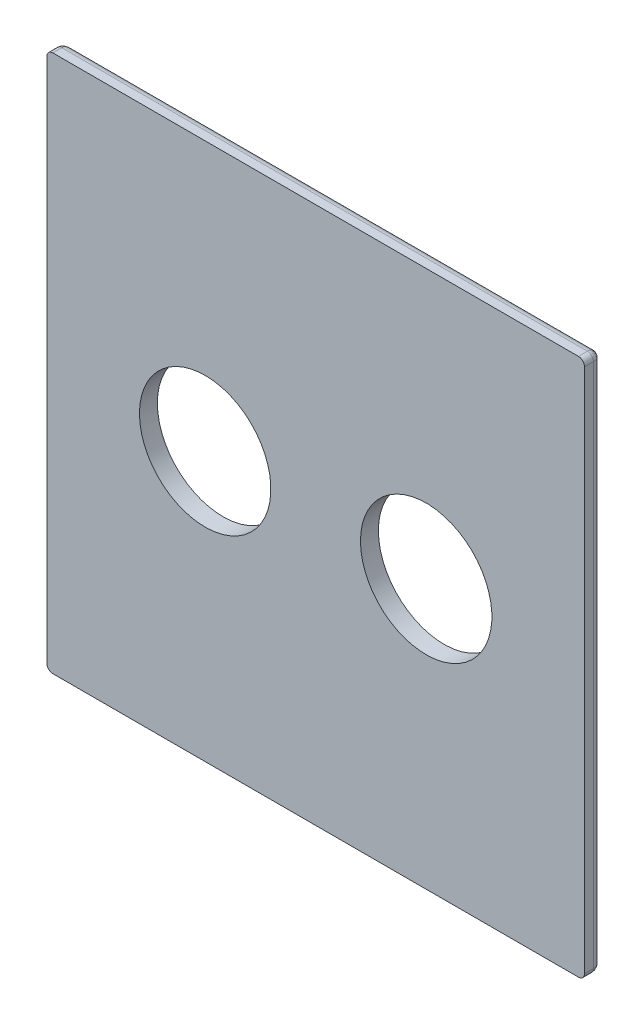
ISO-10303-21;
HEADER;
FILE_DESCRIPTION(('STEP AP214'),'2;1');
FILE_NAME('part.step','',(''),(''),'','','');
FILE_SCHEMA(('AUTOMOTIVE_DESIGN { 1 0 10303 214 1 1 1 1 }'));
ENDSEC;
DATA;
#1=APPLICATION_CONTEXT('core data for automotive mechanical design processes');
#2=APPLICATION_PROTOCOL_DEFINITION('international standard','automotive_design',2000,#1);
#3=PRODUCT_CONTEXT('',#1,'mechanical');
#4=PRODUCT('Part','Part','',(#3));
#5=PRODUCT_RELATED_PRODUCT_CATEGORY('part','',(#4));
#6=PRODUCT_DEFINITION_FORMATION('','',#4);
#7=PRODUCT_DEFINITION_CONTEXT('part definition',#1,'design');
#8=PRODUCT_DEFINITION('design','',#6,#7);
#9=PRODUCT_DEFINITION_SHAPE('','',#8);
#10=(LENGTH_UNIT() NAMED_UNIT(*) SI_UNIT(.MILLI.,.METRE.));
#11=(NAMED_UNIT(*) PLANE_ANGLE_UNIT() SI_UNIT($,.RADIAN.));
#12=(NAMED_UNIT(*) SI_UNIT($,.STERADIAN.) SOLID_ANGLE_UNIT());
#13=UNCERTAINTY_MEASURE_WITH_UNIT(LENGTH_MEASURE(1.E-05),#10,'distance_accuracy_value','');
#14=(GEOMETRIC_REPRESENTATION_CONTEXT(3) GLOBAL_UNCERTAINTY_ASSIGNED_CONTEXT((#13)) GLOBAL_UNIT_ASSIGNED_CONTEXT((#10,
#11,#12)) REPRESENTATION_CONTEXT('',''));
#15=CARTESIAN_POINT('',(0.,0.,0.));
#16=DIRECTION('',(0.,0.,1.));
#17=DIRECTION('',(1.,0.,0.));
#18=AXIS2_PLACEMENT_3D('',#15,#16,#17);
#19=CARTESIAN_POINT('',(44.,-45.,1.5));
#20=CARTESIAN_POINT('',(44.1495996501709,-45.,1.5));
#21=CARTESIAN_POINT('',(44.3738179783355,-44.9486369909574,1.5));
#22=CARTESIAN_POINT('',(44.6286992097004,-44.7883198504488,1.5));
#23=CARTESIAN_POINT('',(44.815061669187,-44.6021470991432,1.5));
#24=CARTESIAN_POINT('',(44.9618744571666,-44.3365612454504,1.5));
#25=CARTESIAN_POINT('',(45.,-44.1121997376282,1.5));
#26=CARTESIAN_POINT('',(45.,-44.,1.5));
#27=CARTESIAN_POINT('',(44.,-45.,1.38780026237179));
#28=CARTESIAN_POINT('',(44.1495996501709,-45.,1.3765841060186));
#29=CARTESIAN_POINT('',(44.3738179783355,-44.9486369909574,1.36367785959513));
#30=CARTESIAN_POINT('',(44.6286992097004,-44.7883198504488,1.35659921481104));
#31=CARTESIAN_POINT('',(44.815061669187,-44.6021470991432,1.3565890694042));
#32=CARTESIAN_POINT('',(44.9618744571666,-44.3365612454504,1.36547389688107));
#33=CARTESIAN_POINT('',(45.,-44.1121997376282,1.37940644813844));
#34=CARTESIAN_POINT('',(45.,-44.,1.38780026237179));
#35=CARTESIAN_POINT('',(43.9915290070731,-44.9745870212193,1.16354424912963));
#36=CARTESIAN_POINT('',(44.1352791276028,-44.9694358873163,1.13007528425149));
#37=CARTESIAN_POINT('',(44.3507424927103,-44.9134457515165,1.09154209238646));
#38=CARTESIAN_POINT('',(44.5975953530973,-44.7537321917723,1.07040899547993));
#39=CARTESIAN_POINT('',(44.7798730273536,-44.5716177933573,1.07037784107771));
#40=CARTESIAN_POINT('',(44.9271429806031,-44.3149302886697,1.09690476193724));
#41=CARTESIAN_POINT('',(44.9707116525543,-44.0993392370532,1.13849398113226));
#42=CARTESIAN_POINT('',(44.9745870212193,-43.9915290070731,1.16354424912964));
#43=CARTESIAN_POINT('',(43.9419195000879,-44.8257585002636,0.736975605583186));
#44=CARTESIAN_POINT('',(44.0557427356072,-44.7962162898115,0.680637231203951));
#45=CARTESIAN_POINT('',(44.2264648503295,-44.7204085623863,0.617015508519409));
#46=CARTESIAN_POINT('',(44.4308947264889,-44.5673073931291,0.582383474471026));
#47=CARTESIAN_POINT('',(44.5901157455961,-44.4081734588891,0.582345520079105));
#48=CARTESIAN_POINT('',(44.7358556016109,-44.1980442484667,0.625770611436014));
#49=CARTESIAN_POINT('',(44.8036739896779,-44.0273088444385,0.694786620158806));
#50=CARTESIAN_POINT('',(44.8257585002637,-43.9419195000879,0.736975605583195));
#51=CARTESIAN_POINT('',(43.8462795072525,-44.5388385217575,0.377495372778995));
#52=CARTESIAN_POINT('',(43.9223655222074,-44.4924880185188,0.337547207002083));
#53=CARTESIAN_POINT('',(44.036523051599,-44.4109760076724,0.293818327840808));
#54=CARTESIAN_POINT('',(44.1810914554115,-44.2838412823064,0.270305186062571));
#55=CARTESIAN_POINT('',(44.3009930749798,-44.1639660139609,0.270293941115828));
#56=CARTESIAN_POINT('',(44.4256165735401,-44.0174986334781,0.299724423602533));
#57=CARTESIAN_POINT('',(44.504138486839,-43.9033613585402,0.347551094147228));
#58=CARTESIAN_POINT('',(44.5388385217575,-43.8462795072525,0.377495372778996));
#59=CARTESIAN_POINT('',(43.6868592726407,-44.0605778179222,0.077186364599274));
#60=CARTESIAN_POINT('',(43.7226866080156,-44.0254468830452,0.066456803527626));
#61=CARTESIAN_POINT('',(43.7764620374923,-43.9725851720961,0.055005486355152));
#62=CARTESIAN_POINT('',(43.8479796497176,-43.9014686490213,0.048911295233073));
#63=CARTESIAN_POINT('',(43.9104029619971,-43.8390620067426,0.048911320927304));
#64=CARTESIAN_POINT('',(43.9814436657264,-43.7674966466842,0.056527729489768));
#65=CARTESIAN_POINT('',(44.034292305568,-43.7137463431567,0.069135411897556));
#66=CARTESIAN_POINT('',(44.0605778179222,-43.6868592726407,0.077186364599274));
#67=CARTESIAN_POINT('',(43.5747998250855,-43.7243994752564,0.));
#68=CARTESIAN_POINT('',(43.589047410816,-43.7101518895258,0.));
#69=CARTESIAN_POINT('',(43.6104187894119,-43.68878051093,0.));
#70=CARTESIAN_POINT('',(43.638913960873,-43.6602853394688,0.));
#71=CARTESIAN_POINT('',(43.6638472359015,-43.6353520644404,0.));
#72=CARTESIAN_POINT('',(43.6923424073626,-43.6068568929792,0.));
#73=CARTESIAN_POINT('',(43.7137137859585,-43.5854855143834,0.));
#74=CARTESIAN_POINT('',(43.7243994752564,-43.5747998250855,0.));
#75=CARTESIAN_POINT('',(43.5,-43.5,0.));
#76=CARTESIAN_POINT('',(43.5,-43.5,0.));
#77=CARTESIAN_POINT('',(43.5,-43.5,0.));
#78=CARTESIAN_POINT('',(43.5,-43.5,0.));
#79=CARTESIAN_POINT('',(43.5,-43.5,0.));
#80=CARTESIAN_POINT('',(43.5,-43.5,0.));
#81=CARTESIAN_POINT('',(43.5,-43.5,0.));
#82=CARTESIAN_POINT('',(43.5,-43.5,0.));
#83=B_SPLINE_SURFACE_WITH_KNOTS('',3,3,((#19,#20,#21,#22,#23,#24,#25,#26),(#27,#28,#29,#30,#31,
#32,#33,#34),(#35,#36,#37,#38,#39,#40,#41,#42),(#43,#44,#45,#46,#47,#48,#49,#50),(#51,#52,#53,
#54,#55,#56,#57,#58),(#59,#60,#61,#62,#63,#64,#65,#66),(#67,#68,#69,#70,#71,#72,#73,#74),(#75,
#76,#77,#78,#79,#80,#81,#82)),.UNSPECIFIED.,.F.,.F.,.F.,(4,1,1,1,1,4),(4,1,1,1,1,4),(0.,
0.224399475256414,0.448798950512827,0.897597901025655,1.12199737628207,1.5707963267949),(0.,
0.285714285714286,0.428571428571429,0.571428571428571,0.785714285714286,1.),.UNSPECIFIED.);
#84=CARTESIAN_POINT('',(43.5,-43.5,0.));
#85=CARTESIAN_POINT('',(43.7243994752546,-43.5747998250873,0.));
#86=CARTESIAN_POINT('',(44.0605778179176,-43.6868592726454,0.0771863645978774));
#87=CARTESIAN_POINT('',(44.5388385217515,-43.8462795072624,0.377495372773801));
#88=CARTESIAN_POINT('',(44.8257585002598,-43.9419195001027,0.736975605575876));
#89=CARTESIAN_POINT('',(44.9745870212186,-43.9915290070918,1.16354424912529));
#90=CARTESIAN_POINT('',(45.,-44.0000000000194,1.38780026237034));
#91=CARTESIAN_POINT('',(45.,-44.0000000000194,1.5));
#92=B_SPLINE_CURVE_WITH_KNOTS('',3,(#84,#85,#86,#87,#88,#89,#90,#91),.UNSPECIFIED.,.F.,.F.,(4,1,
1,1,1,4),(0.,0.448798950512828,0.673198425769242,1.12199737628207,1.34639685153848,
1.5707963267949),.UNSPECIFIED.);
#93=CARTESIAN_POINT('',(45.,-44.0000000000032,1.5));
#94=VERTEX_POINT('',#93);
#95=CARTESIAN_POINT('',(43.5,-43.5,0.));
#96=VERTEX_POINT('',#95);
#97=EDGE_CURVE('E113',#94,#96,#92,.F.);
#98=CARTESIAN_POINT('',(45.,-44.,1.5));
#99=CARTESIAN_POINT('',(45.,-44.1121997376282,1.5));
#100=CARTESIAN_POINT('',(44.9618744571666,-44.3365612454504,1.5));
#101=CARTESIAN_POINT('',(44.815061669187,-44.6021470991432,1.5));
#102=CARTESIAN_POINT('',(44.6286992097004,-44.7883198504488,1.5));
#103=CARTESIAN_POINT('',(44.3738179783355,-44.9486369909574,1.5));
#104=CARTESIAN_POINT('',(44.1495996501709,-45.,1.5));
#105=CARTESIAN_POINT('',(44.,-45.,1.5));
#106=B_SPLINE_CURVE_WITH_KNOTS('',3,(#98,#99,#100,#101,#102,#103,#104,#105),.UNSPECIFIED.,.F.,
.F.,(4,1,1,1,1,4),(0.,0.214285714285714,0.428571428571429,0.571428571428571,0.714285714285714,
1.),.UNSPECIFIED.);
#107=CARTESIAN_POINT('',(44.,-45.,1.5));
#108=VERTEX_POINT('',#107);
#109=EDGE_CURVE('E96',#94,#108,#106,.T.);
#110=CARTESIAN_POINT('',(44.,-45.,1.5));
#111=CARTESIAN_POINT('',(44.,-45.,1.38780026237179));
#112=CARTESIAN_POINT('',(43.9915290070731,-44.9745870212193,1.16354424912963));
#113=CARTESIAN_POINT('',(43.9419195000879,-44.8257585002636,0.736975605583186));
#114=CARTESIAN_POINT('',(43.8462795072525,-44.5388385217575,0.377495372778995));
#115=CARTESIAN_POINT('',(43.6868592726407,-44.0605778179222,0.077186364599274));
#116=CARTESIAN_POINT('',(43.5747998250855,-43.7243994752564,0.));
#117=CARTESIAN_POINT('',(43.5,-43.5,0.));
#118=B_SPLINE_CURVE_WITH_KNOTS('',3,(#110,#111,#112,#113,#114,#115,#116,#117),.UNSPECIFIED.,.F.,
.F.,(4,1,1,1,1,4),(0.,0.224399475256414,0.448798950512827,0.897597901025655,1.12199737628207,
1.5707963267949),.UNSPECIFIED.);
#119=EDGE_CURVE('E117',#96,#108,#118,.F.);
#120=ORIENTED_EDGE('',*,*,#97,.F.);
#121=ORIENTED_EDGE('',*,*,#109,.T.);
#122=ORIENTED_EDGE('',*,*,#119,.F.);
#123=EDGE_LOOP('',(#120,#121,#122));
#124=FACE_BOUND('',#123,.T.);
#125=ADVANCED_FACE('F15',(#124),#83,.T.);
#126=CARTESIAN_POINT('',(45.,44.,1.5));
#127=CARTESIAN_POINT('',(45.,44.1495996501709,1.5));
#128=CARTESIAN_POINT('',(44.9486369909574,44.3738179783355,1.5));
#129=CARTESIAN_POINT('',(44.7883198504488,44.6286992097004,1.5));
#130=CARTESIAN_POINT('',(44.6021470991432,44.8150616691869,1.5));
#131=CARTESIAN_POINT('',(44.3365612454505,44.9618744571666,1.5));
#132=CARTESIAN_POINT('',(44.1121997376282,45.,1.5));
#133=CARTESIAN_POINT('',(44.,45.,1.5));
#134=CARTESIAN_POINT('',(45.,44.,1.38780026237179));
#135=CARTESIAN_POINT('',(45.,44.1495996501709,1.3765841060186));
#136=CARTESIAN_POINT('',(44.9486369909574,44.3738179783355,1.36367785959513));
#137=CARTESIAN_POINT('',(44.7883198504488,44.6286992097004,1.35659921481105));
#138=CARTESIAN_POINT('',(44.6021470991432,44.8150616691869,1.3565890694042));
#139=CARTESIAN_POINT('',(44.3365612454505,44.9618744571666,1.36547389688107));
#140=CARTESIAN_POINT('',(44.1121997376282,45.,1.37940644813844));
#141=CARTESIAN_POINT('',(44.,45.,1.38780026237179));
#142=CARTESIAN_POINT('',(44.9745870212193,43.9915290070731,1.16354424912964));
#143=CARTESIAN_POINT('',(44.9694358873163,44.1352791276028,1.1300752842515));
#144=CARTESIAN_POINT('',(44.9134457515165,44.3507424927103,1.09154209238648));
#145=CARTESIAN_POINT('',(44.7537321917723,44.5975953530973,1.07040899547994));
#146=CARTESIAN_POINT('',(44.5716177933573,44.7798730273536,1.07037784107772));
#147=CARTESIAN_POINT('',(44.3149302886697,44.9271429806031,1.09690476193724));
#148=CARTESIAN_POINT('',(44.0993392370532,44.9707116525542,1.13849398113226));
#149=CARTESIAN_POINT('',(43.9915290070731,44.9745870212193,1.16354424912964));
#150=CARTESIAN_POINT('',(44.8257585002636,43.9419195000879,0.736975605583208));
#151=CARTESIAN_POINT('',(44.7962162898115,44.0557427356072,0.680637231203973));
#152=CARTESIAN_POINT('',(44.7204085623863,44.2264648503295,0.617015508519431));
#153=CARTESIAN_POINT('',(44.5673073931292,44.4308947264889,0.582383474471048));
#154=CARTESIAN_POINT('',(44.4081734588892,44.5901157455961,0.582345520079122));
#155=CARTESIAN_POINT('',(44.1980442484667,44.7358556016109,0.625770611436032));
#156=CARTESIAN_POINT('',(44.0273088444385,44.8036739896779,0.694786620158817));
#157=CARTESIAN_POINT('',(43.9419195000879,44.8257585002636,0.736975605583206));
#158=CARTESIAN_POINT('',(44.5388385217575,43.8462795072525,0.377495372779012));
#159=CARTESIAN_POINT('',(44.4924880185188,43.9223655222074,0.337547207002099));
#160=CARTESIAN_POINT('',(44.4109760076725,44.036523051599,0.293818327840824));
#161=CARTESIAN_POINT('',(44.2838412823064,44.1810914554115,0.270305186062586));
#162=CARTESIAN_POINT('',(44.163966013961,44.3009930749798,0.270293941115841));
#163=CARTESIAN_POINT('',(44.0174986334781,44.4256165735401,0.299724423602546));
#164=CARTESIAN_POINT('',(43.9033613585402,44.504138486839,0.347551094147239));
#165=CARTESIAN_POINT('',(43.8462795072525,44.5388385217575,0.377495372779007));
#166=CARTESIAN_POINT('',(44.0605778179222,43.6868592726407,0.077186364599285));
#167=CARTESIAN_POINT('',(44.0254468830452,43.7226866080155,0.066456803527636));
#168=CARTESIAN_POINT('',(43.9725851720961,43.7764620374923,0.055005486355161));
#169=CARTESIAN_POINT('',(43.9014686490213,43.8479796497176,0.048911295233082));
#170=CARTESIAN_POINT('',(43.8390620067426,43.9104029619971,0.048911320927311));
#171=CARTESIAN_POINT('',(43.7674966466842,43.9814436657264,0.056527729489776));
#172=CARTESIAN_POINT('',(43.7137463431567,44.034292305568,0.069135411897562));
#173=CARTESIAN_POINT('',(43.6868592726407,44.0605778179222,0.077186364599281));
#174=CARTESIAN_POINT('',(43.7243994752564,43.5747998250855,0.));
#175=CARTESIAN_POINT('',(43.7101518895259,43.589047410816,0.));
#176=CARTESIAN_POINT('',(43.68878051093,43.6104187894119,0.));
#177=CARTESIAN_POINT('',(43.6602853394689,43.638913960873,0.));
#178=CARTESIAN_POINT('',(43.6353520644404,43.6638472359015,0.));
#179=CARTESIAN_POINT('',(43.6068568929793,43.6923424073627,0.));
#180=CARTESIAN_POINT('',(43.5854855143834,43.7137137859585,0.));
#181=CARTESIAN_POINT('',(43.5747998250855,43.7243994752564,0.));
#182=CARTESIAN_POINT('',(43.5,43.5,0.));
#183=CARTESIAN_POINT('',(43.5,43.5,0.));
#184=CARTESIAN_POINT('',(43.5,43.5,0.));
#185=CARTESIAN_POINT('',(43.5,43.5,0.));
#186=CARTESIAN_POINT('',(43.5,43.5,0.));
#187=CARTESIAN_POINT('',(43.5,43.5,0.));
#188=CARTESIAN_POINT('',(43.5,43.5,0.));
#189=CARTESIAN_POINT('',(43.5,43.5,0.));
#190=B_SPLINE_SURFACE_WITH_KNOTS('',3,3,((#126,#127,#128,#129,#130,#131,#132,#133),(#134,#135,
#136,#137,#138,#139,#140,#141),(#142,#143,#144,#145,#146,#147,#148,#149),(#150,#151,#152,#153,
#154,#155,#156,#157),(#158,#159,#160,#161,#162,#163,#164,#165),(#166,#167,#168,#169,#170,#171,
#172,#173),(#174,#175,#176,#177,#178,#179,#180,#181),(#182,#183,#184,#185,#186,#187,#188,#189)),
.UNSPECIFIED.,.F.,.F.,.F.,(4,1,1,1,1,4),(4,1,1,1,1,4),(0.,0.224399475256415,0.448798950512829,
0.897597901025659,1.12199737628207,1.5707963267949),(0.,0.285714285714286,0.428571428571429,
0.571428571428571,0.785714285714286,1.),.UNSPECIFIED.);
#191=CARTESIAN_POINT('',(43.5,43.5,0.));
#192=CARTESIAN_POINT('',(43.574799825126,43.7243994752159,0.));
#193=CARTESIAN_POINT('',(43.6868592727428,44.0605778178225,0.0771863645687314));
#194=CARTESIAN_POINT('',(43.8462795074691,44.5388385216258,0.377495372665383));
#195=CARTESIAN_POINT('',(43.9419195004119,44.8257585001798,0.736975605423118));
#196=CARTESIAN_POINT('',(43.9915290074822,44.9745870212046,1.16354424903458));
#197=CARTESIAN_POINT('',(44.0000000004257,45.,1.38780026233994));
#198=CARTESIAN_POINT('',(44.0000000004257,45.,1.5));
#199=B_SPLINE_CURVE_WITH_KNOTS('',3,(#191,#192,#193,#194,#195,#196,#197,#198),.UNSPECIFIED.,.F.,
.F.,(4,1,1,1,1,4),(0.,0.448798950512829,0.673198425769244,1.12199737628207,1.34639685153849,
1.5707963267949),.UNSPECIFIED.);
#200=CARTESIAN_POINT('',(44.0000000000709,45.,1.5));
#201=VERTEX_POINT('',#200);
#202=CARTESIAN_POINT('',(43.5,43.5,0.));
#203=VERTEX_POINT('',#202);
#204=EDGE_CURVE('E225',#201,#203,#199,.F.);
#205=CARTESIAN_POINT('',(44.,45.,1.5));
#206=CARTESIAN_POINT('',(44.0130898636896,45.0000000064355,1.5));
#207=CARTESIAN_POINT('',(44.0261796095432,44.99974053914,1.5));
#208=CARTESIAN_POINT('',(44.0523386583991,44.9987060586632,1.5));
#209=CARTESIAN_POINT('',(44.0654079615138,44.9979310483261,1.5));
#210=CARTESIAN_POINT('',(44.0915061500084,44.9958688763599,1.5));
#211=CARTESIAN_POINT('',(44.1045350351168,44.9945817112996,1.5));
#212=CARTESIAN_POINT('',(44.1305324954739,44.9914986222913,1.5));
#213=CARTESIAN_POINT('',(44.1435010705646,44.9897026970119,1.5));
#214=CARTESIAN_POINT('',(44.1693579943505,44.9856054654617,1.5));
#215=CARTESIAN_POINT('',(44.1822463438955,44.9833041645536,1.5));
#216=CARTESIAN_POINT('',(44.2079229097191,44.9781995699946,1.5));
#217=CARTESIAN_POINT('',(44.2207111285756,44.9753962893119,1.5));
#218=CARTESIAN_POINT('',(44.2461675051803,44.9692910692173,1.5));
#219=CARTESIAN_POINT('',(44.2588356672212,44.9659891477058,1.5));
#220=CARTESIAN_POINT('',(44.2840320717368,44.9588901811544,1.5));
#221=CARTESIAN_POINT('',(44.2965603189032,44.9550931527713,1.5));
#222=CARTESIAN_POINT('',(44.3214567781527,44.9470067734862,1.5));
#223=CARTESIAN_POINT('',(44.3338249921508,44.9427174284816,1.5));
#224=CARTESIAN_POINT('',(44.3583822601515,44.933652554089,1.5));
#225=CARTESIAN_POINT('',(44.3705713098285,44.9288770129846,1.5));
#226=CARTESIAN_POINT('',(44.394752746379,44.9188503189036,1.5));
#227=CARTESIAN_POINT('',(44.4067451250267,44.913599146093,1.5));
#228=CARTESIAN_POINT('',(44.4305154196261,44.9026308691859,1.5));
#229=CARTESIAN_POINT('',(44.4422933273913,44.8969137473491,1.5));
#230=CARTESIAN_POINT('',(44.4656169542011,44.8850234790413,1.5));
#231=CARTESIAN_POINT('',(44.4771626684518,44.8788503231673,1.5));
#232=CARTESIAN_POINT('',(44.500004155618,44.8660578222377,1.5));
#233=CARTESIAN_POINT('',(44.5112999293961,44.8594384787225,1.5));
#234=CARTESIAN_POINT('',(44.5336237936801,44.8457634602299,1.5));
#235=CARTESIAN_POINT('',(44.5446518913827,44.8387077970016,1.5));
#236=CARTESIAN_POINT('',(44.56642263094,44.8241699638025,1.5));
#237=CARTESIAN_POINT('',(44.5771652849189,44.8166878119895,1.5));
#238=CARTESIAN_POINT('',(44.5983474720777,44.8013069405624,1.5));
#239=CARTESIAN_POINT('',(44.6087870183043,44.7934082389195,1.5));
#240=CARTESIAN_POINT('',(44.6293449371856,44.777203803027,1.5));
#241=CARTESIAN_POINT('',(44.639463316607,44.7688980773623,1.5));
#242=CARTESIAN_POINT('',(44.6593647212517,44.7518939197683,1.5));
#243=CARTESIAN_POINT('',(44.669147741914,44.7431954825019,1.5));
#244=CARTESIAN_POINT('',(44.6883649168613,44.7254208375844,1.5));
#245=CARTESIAN_POINT('',(44.6977990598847,44.7163446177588,1.5));
#246=CARTESIAN_POINT('',(44.7163047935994,44.6978291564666,1.5));
#247=CARTESIAN_POINT('',(44.7253763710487,44.6883899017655,1.5));
#248=CARTESIAN_POINT('',(44.7431433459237,44.6691631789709,1.5));
#249=CARTESIAN_POINT('',(44.7518387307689,44.6593756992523,1.5));
#250=CARTESIAN_POINT('',(44.7688396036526,44.63946725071,1.5));
#251=CARTESIAN_POINT('',(44.7771450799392,44.6293462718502,1.5));
#252=CARTESIAN_POINT('',(44.7933526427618,44.6087858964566,1.5));
#253=CARTESIAN_POINT('',(44.8012547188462,44.5983464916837,1.5));
#254=CARTESIAN_POINT('',(44.8166438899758,44.5771661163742,1.5));
#255=CARTESIAN_POINT('',(44.8241309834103,44.5664251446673,1.5));
#256=CARTESIAN_POINT('',(44.8386784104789,44.5446583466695,1.5));
#257=CARTESIAN_POINT('',(44.8457387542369,44.5336325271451,1.5));
#258=CARTESIAN_POINT('',(44.8594208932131,44.5113127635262,1.5));
#259=CARTESIAN_POINT('',(44.8660427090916,44.5000188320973,1.5));
#260=CARTESIAN_POINT('',(44.8788361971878,44.4771796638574,1.5));
#261=CARTESIAN_POINT('',(44.8850078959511,44.4656344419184,1.5));
#262=CARTESIAN_POINT('',(44.8968888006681,44.4423091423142,1.5));
#263=CARTESIAN_POINT('',(44.9025980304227,44.4305290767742,1.5));
#264=CARTESIAN_POINT('',(44.9135450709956,44.4067521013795,1.5));
#265=CARTESIAN_POINT('',(44.9187828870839,44.3947551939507,1.5));
#266=CARTESIAN_POINT('',(44.9287829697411,44.3705644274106,1.5));
#267=CARTESIAN_POINT('',(44.933545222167,44.3583705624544,1.5));
#268=CARTESIAN_POINT('',(44.9425891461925,44.3338053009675,1.5));
#269=CARTESIAN_POINT('',(44.9468707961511,44.3214338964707,1.5));
#270=CARTESIAN_POINT('',(44.954948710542,44.2965330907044,1.5));
#271=CARTESIAN_POINT('',(44.9587449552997,44.2840036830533,1.5));
#272=CARTESIAN_POINT('',(44.9658471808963,44.2588063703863,1.5));
#273=CARTESIAN_POINT('',(44.9691531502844,44.2461384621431,1.5));
#274=CARTESIAN_POINT('',(44.9752699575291,44.2206836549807,1.5));
#275=CARTESIAN_POINT('',(44.9780807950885,44.2078967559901,1.5));
#276=CARTESIAN_POINT('',(44.9832024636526,44.1822234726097,1.5));
#277=CARTESIAN_POINT('',(44.985513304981,44.1693370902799,1.5));
#278=CARTESIAN_POINT('',(44.9896301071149,44.1434843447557,1.5));
#279=CARTESIAN_POINT('',(44.9914360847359,44.13051798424,1.5));
#280=CARTESIAN_POINT('',(44.9945382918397,44.1045247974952,1.5));
#281=CARTESIAN_POINT('',(44.9958345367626,44.0914979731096,1.5));
#282=CARTESIAN_POINT('',(44.9979124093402,44.0654033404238,1.5));
#283=CARTESIAN_POINT('',(44.9986940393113,44.0523355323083,1.5));
#284=CARTESIAN_POINT('',(44.9997378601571,44.0261785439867,1.5));
#285=CARTESIAN_POINT('',(45.0000000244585,44.0130893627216,1.5));
#286=CARTESIAN_POINT('',(45.,44.,1.5));
#287=B_SPLINE_CURVE_WITH_KNOTS('',3,(#205,#206,#207,#208,#209,#210,#211,#212,#213,#214,#215,
#216,#217,#218,#219,#220,#221,#222,#223,#224,#225,#226,#227,#228,#229,#230,#231,#232,#233,#234,
#235,#236,#237,#238,#239,#240,#241,#242,#243,#244,#245,#246,#247,#248,#249,#250,#251,#252,#253,
#254,#255,#256,#257,#258,#259,#260,#261,#262,#263,#264,#265,#266,#267,#268,#269,#270,#271,#272,
#273,#274,#275,#276,#277,#278,#279,#280,#281,#282,#283,#284,#285,#286),.UNSPECIFIED.,.F.,.F.,(4,
2,2,2,2,2,2,2,2,2,2,2,2,2,2,2,2,2,2,2,2,2,2,2,2,2,2,2,2,2,2,2,2,2,2,2,2,2,2,2,4),(0.,
0.0392668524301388,0.0785334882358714,0.117800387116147,0.157067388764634,0.196333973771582,
0.235599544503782,0.274863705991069,0.314126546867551,0.353388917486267,0.392652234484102,
0.431917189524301,0.471183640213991,0.510450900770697,0.549718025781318,0.588984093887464,
0.628248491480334,0.667511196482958,0.706773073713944,0.746035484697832,0.785299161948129,
0.824564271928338,0.863830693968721,0.903098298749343,0.942366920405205,0.98163569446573,
1.02090353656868,1.06016952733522,1.09943320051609,1.13869485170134,1.17795606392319,
1.21721844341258,1.25648259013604,1.29574832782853,1.33501498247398,1.37428166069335,
1.4135475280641,1.45281208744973,1.49207545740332,1.53133865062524,1.57060385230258),.UNSPECIFIED.);
#288=CARTESIAN_POINT('',(45.,44.,1.5));
#289=VERTEX_POINT('',#288);
#290=EDGE_CURVE('E109',#201,#289,#287,.T.);
#291=CARTESIAN_POINT('',(45.,44.,1.5));
#292=CARTESIAN_POINT('',(45.,44.,1.38780026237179));
#293=CARTESIAN_POINT('',(44.9745870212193,43.9915290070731,1.16354424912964));
#294=CARTESIAN_POINT('',(44.8257585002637,43.9419195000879,0.736975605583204));
#295=CARTESIAN_POINT('',(44.5388385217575,43.8462795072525,0.377495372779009));
#296=CARTESIAN_POINT('',(44.0605778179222,43.6868592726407,0.0771863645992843));
#297=CARTESIAN_POINT('',(43.7243994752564,43.5747998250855,0.));
#298=CARTESIAN_POINT('',(43.5,43.5,0.));
#299=B_SPLINE_CURVE_WITH_KNOTS('',3,(#291,#292,#293,#294,#295,#296,#297,#298),.UNSPECIFIED.,.F.,
.F.,(4,1,1,1,1,4),(0.,0.224399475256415,0.448798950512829,0.897597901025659,1.12199737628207,
1.5707963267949),.UNSPECIFIED.);
#300=EDGE_CURVE('E125',#203,#289,#299,.F.);
#301=ORIENTED_EDGE('',*,*,#204,.F.);
#302=ORIENTED_EDGE('',*,*,#290,.T.);
#303=ORIENTED_EDGE('',*,*,#300,.F.);
#304=EDGE_LOOP('',(#301,#302,#303));
#305=FACE_BOUND('',#304,.T.);
#306=ADVANCED_FACE('F330',(#305),#190,.T.);
#307=CARTESIAN_POINT('',(-44.,45.,1.5));
#308=CARTESIAN_POINT('',(-44.149599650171,45.,1.5));
#309=CARTESIAN_POINT('',(-44.3738179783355,44.9486369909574,1.5));
#310=CARTESIAN_POINT('',(-44.6286992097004,44.7883198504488,1.5));
#311=CARTESIAN_POINT('',(-44.815061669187,44.6021470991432,1.5));
#312=CARTESIAN_POINT('',(-44.9618744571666,44.3365612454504,1.5));
#313=CARTESIAN_POINT('',(-45.,44.1121997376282,1.5));
#314=CARTESIAN_POINT('',(-45.,44.,1.5));
#315=CARTESIAN_POINT('',(-44.,45.,1.38780026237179));
#316=CARTESIAN_POINT('',(-44.149599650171,45.,1.3765841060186));
#317=CARTESIAN_POINT('',(-44.3738179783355,44.9486369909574,1.36367785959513));
#318=CARTESIAN_POINT('',(-44.6286992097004,44.7883198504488,1.35659921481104));
#319=CARTESIAN_POINT('',(-44.815061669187,44.6021470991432,1.3565890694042));
#320=CARTESIAN_POINT('',(-44.9618744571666,44.3365612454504,1.36547389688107));
#321=CARTESIAN_POINT('',(-45.,44.1121997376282,1.37940644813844));
#322=CARTESIAN_POINT('',(-45.,44.,1.38780026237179));
#323=CARTESIAN_POINT('',(-43.99158744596,44.97476233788,1.16338475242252));
#324=CARTESIAN_POINT('',(-44.1351532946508,44.9692850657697,1.12989829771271));
#325=CARTESIAN_POINT('',(-44.3503398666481,44.9129472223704,1.0913999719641));
#326=CARTESIAN_POINT('',(-44.5969903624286,44.7530926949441,1.07029855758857));
#327=CARTESIAN_POINT('',(-44.7792263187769,44.571018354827,1.07026789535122));
#328=CARTESIAN_POINT('',(-44.9266870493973,44.3145733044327,1.09675315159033));
#329=CARTESIAN_POINT('',(-44.9706403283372,44.0992588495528,1.13831965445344));
#330=CARTESIAN_POINT('',(-44.97476233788,43.99158744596,1.16338475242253));
#331=CARTESIAN_POINT('',(-43.9542724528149,44.8628173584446,0.843754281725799));
#332=CARTESIAN_POINT('',(-44.0757412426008,44.8396581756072,0.79317059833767));
#333=CARTESIAN_POINT('',(-44.2578925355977,44.7691042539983,0.73581698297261));
#334=CARTESIAN_POINT('',(-44.4731048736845,44.6144778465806,0.704548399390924));
#335=CARTESIAN_POINT('',(-44.6381244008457,44.4495649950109,0.704511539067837));
#336=CARTESIAN_POINT('',(-44.7840758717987,44.2275840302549,0.743728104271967));
#337=CARTESIAN_POINT('',(-44.8454972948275,44.0453894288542,0.805878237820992));
#338=CARTESIAN_POINT('',(-44.8628173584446,43.9542724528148,0.843754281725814));
#339=CARTESIAN_POINT('',(-43.8742565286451,44.6227695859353,0.461142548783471));
#340=CARTESIAN_POINT('',(-43.9596864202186,44.578664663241,0.41371384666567));
#341=CARTESIAN_POINT('',(-44.0878690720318,44.4960491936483,0.361350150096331));
#342=CARTESIAN_POINT('',(-44.2480507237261,44.360236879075,0.333100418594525));
#343=CARTESIAN_POINT('',(-44.3789740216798,44.2293531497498,0.333081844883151));
#344=CARTESIAN_POINT('',(-44.51127532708,44.0665092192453,0.36845890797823));
#345=CARTESIAN_POINT('',(-44.5897773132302,43.9383532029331,0.425599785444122));
#346=CARTESIAN_POINT('',(-44.6227695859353,43.8742565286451,0.461142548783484));
#347=CARTESIAN_POINT('',(-43.724383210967,44.173149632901,0.102460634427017));
#348=CARTESIAN_POINT('',(-43.7669260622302,44.1301594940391,0.088220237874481));
#349=CARTESIAN_POINT('',(-43.8307795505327,44.0658620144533,0.073204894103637));
#350=CARTESIAN_POINT('',(-43.9160957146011,43.9801877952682,0.065253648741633));
#351=CARTESIAN_POINT('',(-43.9908895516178,43.9054100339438,0.065255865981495));
#352=CARTESIAN_POINT('',(-44.0765951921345,43.8201331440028,0.075185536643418));
#353=CARTESIAN_POINT('',(-44.1409764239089,43.7563084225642,0.091772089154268));
#354=CARTESIAN_POINT('',(-44.1731496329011,43.724383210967,0.102460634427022));
#355=CARTESIAN_POINT('',(-43.5747998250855,43.7243994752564,0.));
#356=CARTESIAN_POINT('',(-43.5890474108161,43.7101518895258,0.));
#357=CARTESIAN_POINT('',(-43.6104187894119,43.6887805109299,0.));
#358=CARTESIAN_POINT('',(-43.638913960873,43.6602853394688,0.));
#359=CARTESIAN_POINT('',(-43.6638472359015,43.6353520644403,0.));
#360=CARTESIAN_POINT('',(-43.6923424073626,43.6068568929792,0.));
#361=CARTESIAN_POINT('',(-43.7137137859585,43.5854855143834,0.));
#362=CARTESIAN_POINT('',(-43.7243994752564,43.5747998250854,0.));
#363=CARTESIAN_POINT('',(-43.5,43.5,0.));
#364=CARTESIAN_POINT('',(-43.5,43.5,0.));
#365=CARTESIAN_POINT('',(-43.5,43.4999999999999,0.));
#366=CARTESIAN_POINT('',(-43.5,43.5,0.));
#367=CARTESIAN_POINT('',(-43.5,43.4999999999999,0.));
#368=CARTESIAN_POINT('',(-43.5,43.5,0.));
#369=CARTESIAN_POINT('',(-43.5,43.5,0.));
#370=CARTESIAN_POINT('',(-43.5,43.5,0.));
#371=B_SPLINE_SURFACE_WITH_KNOTS('',3,3,((#307,#308,#309,#310,#311,#312,#313,#314),(#315,#316,
#317,#318,#319,#320,#321,#322),(#323,#324,#325,#326,#327,#328,#329,#330),(#331,#332,#333,#334,
#335,#336,#337,#338),(#339,#340,#341,#342,#343,#344,#345,#346),(#347,#348,#349,#350,#351,#352,
#353,#354),(#355,#356,#357,#358,#359,#360,#361,#362),(#363,#364,#365,#366,#367,#368,#369,#370)),
.UNSPECIFIED.,.F.,.F.,.F.,(4,1,1,1,1,4),(4,1,1,1,1,4),(0.,0.224399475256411,0.448798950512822,
0.673198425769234,1.12199737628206,1.57079632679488),(0.,0.285714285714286,0.428571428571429,
0.571428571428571,0.785714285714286,1.),.UNSPECIFIED.);
#372=CARTESIAN_POINT('',(-43.5,43.5,0.));
#373=CARTESIAN_POINT('',(-43.7243994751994,43.5747998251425,0.));
#374=CARTESIAN_POINT('',(-44.1731496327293,43.7243832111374,0.102460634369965));
#375=CARTESIAN_POINT('',(-44.6227695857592,43.8742565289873,0.461142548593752));
#376=CARTESIAN_POINT('',(-44.8628173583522,43.9542724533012,0.843754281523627));
#377=CARTESIAN_POINT('',(-44.974762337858,43.9915874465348,1.16338475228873));
#378=CARTESIAN_POINT('',(-45.,44.0000000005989,1.38780026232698));
#379=CARTESIAN_POINT('',(-45.,44.0000000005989,1.5));
#380=B_SPLINE_CURVE_WITH_KNOTS('',3,(#372,#373,#374,#375,#376,#377,#378,#379),.UNSPECIFIED.,.F.,
.F.,(4,1,1,1,1,4),(0.,0.448798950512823,0.897597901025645,1.12199737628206,1.34639685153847,
1.57079632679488),.UNSPECIFIED.);
#381=CARTESIAN_POINT('',(-45.,44.0000000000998,1.5));
#382=VERTEX_POINT('',#381);
#383=CARTESIAN_POINT('',(-43.5,43.5,0.));
#384=VERTEX_POINT('',#383);
#385=EDGE_CURVE('E173',#382,#384,#380,.F.);
#386=CARTESIAN_POINT('',(-45.,44.,1.5));
#387=CARTESIAN_POINT('',(-45.0000000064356,44.0130898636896,1.5));
#388=CARTESIAN_POINT('',(-44.99974053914,44.0261796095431,1.5));
#389=CARTESIAN_POINT('',(-44.9987060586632,44.052338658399,1.5));
#390=CARTESIAN_POINT('',(-44.9979310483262,44.0654079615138,1.5));
#391=CARTESIAN_POINT('',(-44.99586887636,44.0915061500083,1.5));
#392=CARTESIAN_POINT('',(-44.9945817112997,44.1045350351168,1.5));
#393=CARTESIAN_POINT('',(-44.9914986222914,44.1305324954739,1.5));
#394=CARTESIAN_POINT('',(-44.9897026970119,44.1435010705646,1.5));
#395=CARTESIAN_POINT('',(-44.9856054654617,44.1693579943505,1.5));
#396=CARTESIAN_POINT('',(-44.9833041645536,44.1822463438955,1.5));
#397=CARTESIAN_POINT('',(-44.9781995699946,44.2079229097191,1.5));
#398=CARTESIAN_POINT('',(-44.9753962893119,44.2207111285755,1.5));
#399=CARTESIAN_POINT('',(-44.9692910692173,44.2461675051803,1.5));
#400=CARTESIAN_POINT('',(-44.9659891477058,44.2588356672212,1.5));
#401=CARTESIAN_POINT('',(-44.9588901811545,44.2840320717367,1.5));
#402=CARTESIAN_POINT('',(-44.9550931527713,44.2965603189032,1.5));
#403=CARTESIAN_POINT('',(-44.9470067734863,44.3214567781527,1.5));
#404=CARTESIAN_POINT('',(-44.9427174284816,44.3338249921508,1.5));
#405=CARTESIAN_POINT('',(-44.9336525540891,44.3583822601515,1.5));
#406=CARTESIAN_POINT('',(-44.9288770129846,44.3705713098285,1.5));
#407=CARTESIAN_POINT('',(-44.9188503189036,44.394752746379,1.5));
#408=CARTESIAN_POINT('',(-44.913599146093,44.4067451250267,1.5));
#409=CARTESIAN_POINT('',(-44.9026308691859,44.4305154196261,1.5));
#410=CARTESIAN_POINT('',(-44.8969137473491,44.4422933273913,1.5));
#411=CARTESIAN_POINT('',(-44.8850234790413,44.4656169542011,1.5));
#412=CARTESIAN_POINT('',(-44.8788503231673,44.4771626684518,1.5));
#413=CARTESIAN_POINT('',(-44.8660578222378,44.5000041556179,1.5));
#414=CARTESIAN_POINT('',(-44.8594384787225,44.5112999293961,1.5));
#415=CARTESIAN_POINT('',(-44.8457634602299,44.5336237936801,1.5));
#416=CARTESIAN_POINT('',(-44.8387077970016,44.5446518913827,1.5));
#417=CARTESIAN_POINT('',(-44.8241699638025,44.56642263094,1.5));
#418=CARTESIAN_POINT('',(-44.8166878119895,44.5771652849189,1.5));
#419=CARTESIAN_POINT('',(-44.8013069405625,44.5983474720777,1.5));
#420=CARTESIAN_POINT('',(-44.7934082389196,44.6087870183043,1.5));
#421=CARTESIAN_POINT('',(-44.777203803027,44.6293449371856,1.5));
#422=CARTESIAN_POINT('',(-44.7688980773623,44.639463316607,1.5));
#423=CARTESIAN_POINT('',(-44.7518939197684,44.6593647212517,1.5));
#424=CARTESIAN_POINT('',(-44.7431954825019,44.669147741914,1.5));
#425=CARTESIAN_POINT('',(-44.7254208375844,44.6883649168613,1.5));
#426=CARTESIAN_POINT('',(-44.7163446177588,44.6977990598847,1.5));
#427=CARTESIAN_POINT('',(-44.6978291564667,44.7163047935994,1.5));
#428=CARTESIAN_POINT('',(-44.6883899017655,44.7253763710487,1.5));
#429=CARTESIAN_POINT('',(-44.6691631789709,44.7431433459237,1.5));
#430=CARTESIAN_POINT('',(-44.6593756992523,44.7518387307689,1.5));
#431=CARTESIAN_POINT('',(-44.6394672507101,44.7688396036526,1.5));
#432=CARTESIAN_POINT('',(-44.6293462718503,44.7771450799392,1.5));
#433=CARTESIAN_POINT('',(-44.6087858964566,44.7933526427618,1.5));
#434=CARTESIAN_POINT('',(-44.5983464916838,44.8012547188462,1.5));
#435=CARTESIAN_POINT('',(-44.5771661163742,44.8166438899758,1.5));
#436=CARTESIAN_POINT('',(-44.5664251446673,44.8241309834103,1.5));
#437=CARTESIAN_POINT('',(-44.5446583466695,44.8386784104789,1.5));
#438=CARTESIAN_POINT('',(-44.5336325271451,44.8457387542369,1.5));
#439=CARTESIAN_POINT('',(-44.5113127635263,44.8594208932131,1.5));
#440=CARTESIAN_POINT('',(-44.5000188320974,44.8660427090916,1.5));
#441=CARTESIAN_POINT('',(-44.4771796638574,44.8788361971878,1.5));
#442=CARTESIAN_POINT('',(-44.4656344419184,44.8850078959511,1.5));
#443=CARTESIAN_POINT('',(-44.4423091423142,44.8968888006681,1.5));
#444=CARTESIAN_POINT('',(-44.4305290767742,44.9025980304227,1.5));
#445=CARTESIAN_POINT('',(-44.4067521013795,44.9135450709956,1.5));
#446=CARTESIAN_POINT('',(-44.3947551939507,44.9187828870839,1.5));
#447=CARTESIAN_POINT('',(-44.3705644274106,44.9287829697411,1.5));
#448=CARTESIAN_POINT('',(-44.3583705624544,44.933545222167,1.5));
#449=CARTESIAN_POINT('',(-44.3338053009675,44.9425891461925,1.5));
#450=CARTESIAN_POINT('',(-44.3214338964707,44.9468707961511,1.5));
#451=CARTESIAN_POINT('',(-44.2965330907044,44.954948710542,1.5));
#452=CARTESIAN_POINT('',(-44.2840036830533,44.9587449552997,1.5));
#453=CARTESIAN_POINT('',(-44.2588063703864,44.9658471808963,1.5));
#454=CARTESIAN_POINT('',(-44.2461384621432,44.9691531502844,1.5));
#455=CARTESIAN_POINT('',(-44.2206836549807,44.9752699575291,1.5));
#456=CARTESIAN_POINT('',(-44.2078967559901,44.9780807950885,1.5));
#457=CARTESIAN_POINT('',(-44.1822234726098,44.9832024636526,1.5));
#458=CARTESIAN_POINT('',(-44.1693370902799,44.985513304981,1.5));
#459=CARTESIAN_POINT('',(-44.1434843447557,44.9896301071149,1.5));
#460=CARTESIAN_POINT('',(-44.13051798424,44.9914360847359,1.5));
#461=CARTESIAN_POINT('',(-44.1045247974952,44.9945382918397,1.5));
#462=CARTESIAN_POINT('',(-44.0914979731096,44.9958345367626,1.5));
#463=CARTESIAN_POINT('',(-44.0654033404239,44.9979124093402,1.5));
#464=CARTESIAN_POINT('',(-44.0523355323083,44.9986940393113,1.5));
#465=CARTESIAN_POINT('',(-44.0261785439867,44.9997378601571,1.5));
#466=CARTESIAN_POINT('',(-44.0130893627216,45.0000000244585,1.5));
#467=CARTESIAN_POINT('',(-44.,45.,1.5));
#468=B_SPLINE_CURVE_WITH_KNOTS('',3,(#386,#387,#388,#389,#390,#391,#392,#393,#394,#395,#396,
#397,#398,#399,#400,#401,#402,#403,#404,#405,#406,#407,#408,#409,#410,#411,#412,#413,#414,#415,
#416,#417,#418,#419,#420,#421,#422,#423,#424,#425,#426,#427,#428,#429,#430,#431,#432,#433,#434,
#435,#436,#437,#438,#439,#440,#441,#442,#443,#444,#445,#446,#447,#448,#449,#450,#451,#452,#453,
#454,#455,#456,#457,#458,#459,#460,#461,#462,#463,#464,#465,#466,#467),.UNSPECIFIED.,.F.,.F.,(4,
2,2,2,2,2,2,2,2,2,2,2,2,2,2,2,2,2,2,2,2,2,2,2,2,2,2,2,2,2,2,2,2,2,2,2,2,2,2,2,4),(0.,
0.0392668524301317,0.0785334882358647,0.11780038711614,0.157067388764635,0.196333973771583,
0.235599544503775,0.274863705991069,0.314126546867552,0.353388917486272,0.3926522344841,
0.431917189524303,0.471183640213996,0.51045090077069,0.549718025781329,0.588984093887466,
0.628248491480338,0.667511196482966,0.706773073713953,0.746035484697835,0.785299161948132,
0.824564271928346,0.86383069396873,0.903098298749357,0.942366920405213,0.981635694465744,
1.02090353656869,1.06016952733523,1.0994332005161,1.13869485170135,1.17795606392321,
1.21721844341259,1.25648259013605,1.29574832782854,1.335014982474,1.37428166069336,
1.41354752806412,1.45281208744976,1.49207545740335,1.53133865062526,1.5706038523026),.UNSPECIFIED.);
#469=CARTESIAN_POINT('',(-44.,45.,1.5));
#470=VERTEX_POINT('',#469);
#471=EDGE_CURVE('E357',#382,#470,#468,.T.);
#472=CARTESIAN_POINT('',(-44.,45.,1.5));
#473=CARTESIAN_POINT('',(-44.0000000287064,45.0000000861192,1.48036419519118));
#474=CARTESIAN_POINT('',(-43.9998711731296,44.9996135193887,1.46072850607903));
#475=CARTESIAN_POINT('',(-43.9993568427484,44.9980705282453,1.42148707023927));
#476=CARTESIAN_POINT('',(-43.9989713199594,44.9969139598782,1.40188132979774));
#477=CARTESIAN_POINT('',(-43.9979446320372,44.9938338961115,1.36273026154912));
#478=CARTESIAN_POINT('',(-43.9973033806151,44.9919101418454,1.34318495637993));
#479=CARTESIAN_POINT('',(-43.9957662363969,44.9872987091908,1.30418514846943));
#480=CARTESIAN_POINT('',(-43.9948702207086,44.9846106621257,1.28473069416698));
#481=CARTESIAN_POINT('',(-43.9928245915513,44.978473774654,1.24594295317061));
#482=CARTESIAN_POINT('',(-43.9916748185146,44.9750244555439,1.22660975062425));
#483=CARTESIAN_POINT('',(-43.9891225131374,44.9673675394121,1.18809500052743));
#484=CARTESIAN_POINT('',(-43.9877197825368,44.9631593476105,1.16891358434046));
#485=CARTESIAN_POINT('',(-43.9846632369,44.9539897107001,1.13073226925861));
#486=CARTESIAN_POINT('',(-43.9830091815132,44.9490275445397,1.11173256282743));
#487=CARTESIAN_POINT('',(-43.9794538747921,44.9383616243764,1.07394245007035));
#488=CARTESIAN_POINT('',(-43.9775523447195,44.9326570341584,1.05515230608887));
#489=CARTESIAN_POINT('',(-43.9735056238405,44.9205168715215,1.01780927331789));
#490=CARTESIAN_POINT('',(-43.9713601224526,44.9140803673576,0.999256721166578));
#491=CARTESIAN_POINT('',(-43.9668290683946,44.9004872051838,0.962416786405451));
#492=CARTESIAN_POINT('',(-43.9644431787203,44.8933295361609,0.94412981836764));
#493=CARTESIAN_POINT('',(-43.9594349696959,44.8783049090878,0.90784890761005));
#494=CARTESIAN_POINT('',(-43.956812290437,44.8704368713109,0.889855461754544));
#495=CARTESIAN_POINT('',(-43.951333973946,44.854001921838,0.854189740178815));
#496=CARTESIAN_POINT('',(-43.9484779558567,44.8454338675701,0.836518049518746));
#497=CARTESIAN_POINT('',(-43.9425373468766,44.8276120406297,0.801523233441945));
#498=CARTESIAN_POINT('',(-43.9394523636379,44.8183570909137,0.784200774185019));
#499=CARTESIAN_POINT('',(-43.933058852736,44.7991765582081,0.749931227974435));
#500=CARTESIAN_POINT('',(-43.9297499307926,44.7892497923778,0.732984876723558));
#501=CARTESIAN_POINT('',(-43.9229134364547,44.768740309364,0.699494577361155));
#502=CARTESIAN_POINT('',(-43.9193854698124,44.7581564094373,0.682951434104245));
#503=CARTESIAN_POINT('',(-43.912115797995,44.736347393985,0.650294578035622));
#504=CARTESIAN_POINT('',(-43.908373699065,44.7251210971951,0.634181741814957));
#505=CARTESIAN_POINT('',(-43.9006807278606,44.7020421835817,0.602412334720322));
#506=CARTESIAN_POINT('',(-43.8967294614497,44.6901883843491,0.586756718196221));
#507=CARTESIAN_POINT('',(-43.8886228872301,44.6658686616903,0.55592934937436));
#508=CARTESIAN_POINT('',(-43.8844671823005,44.6534015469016,0.540758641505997));
#509=CARTESIAN_POINT('',(-43.8759593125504,44.6278779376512,0.510921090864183));
#510=CARTESIAN_POINT('',(-43.8716067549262,44.6148202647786,0.496255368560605));
#511=CARTESIAN_POINT('',(-43.8627131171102,44.5881393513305,0.467446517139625));
#512=CARTESIAN_POINT('',(-43.8581716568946,44.5745149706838,0.453304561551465));
#513=CARTESIAN_POINT('',(-43.8489080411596,44.5467241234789,0.425562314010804));
#514=CARTESIAN_POINT('',(-43.8441855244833,44.53255657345,0.41196322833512));
#515=CARTESIAN_POINT('',(-43.834567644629,44.503702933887,0.385325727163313));
#516=CARTESIAN_POINT('',(-43.8296719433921,44.4890158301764,0.372288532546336));
#517=CARTESIAN_POINT('',(-43.819715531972,44.4591465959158,0.346793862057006));
#518=CARTESIAN_POINT('',(-43.814654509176,44.443963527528,0.334337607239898));
#519=CARTESIAN_POINT('',(-43.8043752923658,44.4131258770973,0.310023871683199));
#520=CARTESIAN_POINT('',(-43.7991568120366,44.3974704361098,0.29816760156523));
#521=CARTESIAN_POINT('',(-43.7885705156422,44.3657115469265,0.275072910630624));
#522=CARTESIAN_POINT('',(-43.7832024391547,44.349607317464,0.263835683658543));
#523=CARTESIAN_POINT('',(-43.7723247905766,44.3169743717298,0.241998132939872));
#524=CARTESIAN_POINT('',(-43.7668149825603,44.300444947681,0.231398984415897));
#525=CARTESIAN_POINT('',(-43.7556616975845,44.2669850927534,0.210856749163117));
#526=CARTESIAN_POINT('',(-43.7500180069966,44.2500540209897,0.20091482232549));
#527=CARTESIAN_POINT('',(-43.7386048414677,44.215814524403,0.181705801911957));
#528=CARTESIAN_POINT('',(-43.7328351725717,44.1985055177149,0.172439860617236));
#529=CARTESIAN_POINT('',(-43.7211777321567,44.16353319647,0.154603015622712));
#530=CARTESIAN_POINT('',(-43.7152897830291,44.1458693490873,0.14603327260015));
#531=CARTESIAN_POINT('',(-43.7034045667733,44.1102137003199,0.129602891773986));
#532=CARTESIAN_POINT('',(-43.6974071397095,44.0922214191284,0.121743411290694));
#533=CARTESIAN_POINT('',(-43.6853130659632,44.0559391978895,0.106739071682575));
#534=CARTESIAN_POINT('',(-43.6792162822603,44.0376488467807,0.0995953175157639));
#535=CARTESIAN_POINT('',(-43.6669333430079,44.0008000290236,0.0860296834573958));
#536=CARTESIAN_POINT('',(-43.6607470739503,43.9822412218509,0.0796088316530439));
#537=CARTESIAN_POINT('',(-43.6482950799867,43.9448852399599,0.0674958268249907));
#538=CARTESIAN_POINT('',(-43.6420292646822,43.9260877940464,0.0618046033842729));
#539=CARTESIAN_POINT('',(-43.6294280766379,43.8882842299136,0.0511578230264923));
#540=CARTESIAN_POINT('',(-43.6230926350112,43.8692779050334,0.0462030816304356));
#541=CARTESIAN_POINT('',(-43.6103620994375,43.8310862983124,0.0370362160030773));
#542=CARTESIAN_POINT('',(-43.6039669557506,43.8119008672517,0.0328247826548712));
#543=CARTESIAN_POINT('',(-43.5911269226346,43.7733807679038,0.0251515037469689));
#544=CARTESIAN_POINT('',(-43.5846819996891,43.7540459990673,0.0216902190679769));
#545=CARTESIAN_POINT('',(-43.5717523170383,43.7152569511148,0.0155242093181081));
#546=CARTESIAN_POINT('',(-43.5652675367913,43.6958026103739,0.0128199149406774));
#547=CARTESIAN_POINT('',(-43.5522680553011,43.6568041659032,0.00817486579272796));
#548=CARTESIAN_POINT('',(-43.5457533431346,43.6372600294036,0.00623441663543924));
#549=CARTESIAN_POINT('',(-43.5327039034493,43.5981117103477,0.00312400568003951));
#550=CARTESIAN_POINT('',(-43.5261691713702,43.5785075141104,0.00195423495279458));
#551=CARTESIAN_POINT('',(-43.5130896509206,43.5392689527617,0.000392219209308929));
#552=CARTESIAN_POINT('',(-43.5065448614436,43.5196345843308,6.69485653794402E-08));
#553=CARTESIAN_POINT('',(-43.5,43.5,0.));
#554=B_SPLINE_CURVE_WITH_KNOTS('',3,(#472,#473,#474,#475,#476,#477,#478,#479,#480,#481,#482,
#483,#484,#485,#486,#487,#488,#489,#490,#491,#492,#493,#494,#495,#496,#497,#498,#499,#500,#501,
#502,#503,#504,#505,#506,#507,#508,#509,#510,#511,#512,#513,#514,#515,#516,#517,#518,#519,#520,
#521,#522,#523,#524,#525,#526,#527,#528,#529,#530,#531,#532,#533,#534,#535,#536,#537,#538,#539,
#540,#541,#542,#543,#544,#545,#546,#547,#548,#549,#550,#551,#552,#553),.UNSPECIFIED.,.F.,.F.,(4,
2,2,2,2,2,2,2,2,2,2,2,2,2,2,2,2,2,2,2,2,2,2,2,2,2,2,2,2,2,2,2,2,2,2,2,2,2,2,2,4),(0.,
0.0589030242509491,0.117817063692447,0.1767509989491,0.235713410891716,0.294713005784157,
0.353759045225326,0.412861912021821,0.472031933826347,0.531278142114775,0.590608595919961,
0.650030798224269,0.709552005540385,0.769177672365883,0.828911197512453,0.888755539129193,
0.948713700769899,1.00878916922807,1.06898633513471,1.12930943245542,1.18976038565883,
1.25033893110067,1.31104307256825,1.37186953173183,1.4328141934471,1.4938725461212,
1.55504011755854,1.61631290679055,1.6776878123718,1.73916302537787,1.80073666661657,
1.86240394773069,1.92415785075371,1.98598966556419,2.04788944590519,2.1098464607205,
2.17184964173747,2.23388802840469,2.29595121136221,2.35802977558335,2.42011574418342),.UNSPECIFIED.);
#555=EDGE_CURVE('E124',#384,#470,#554,.F.);
#556=ORIENTED_EDGE('',*,*,#385,.F.);
#557=ORIENTED_EDGE('',*,*,#471,.T.);
#558=ORIENTED_EDGE('',*,*,#555,.F.);
#559=EDGE_LOOP('',(#556,#557,#558));
#560=FACE_BOUND('',#559,.T.);
#561=ADVANCED_FACE('F319',(#560),#371,.T.);
#562=CARTESIAN_POINT('',(-45.,-44.,1.5));
#563=CARTESIAN_POINT('',(-45.,-44.1495996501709,1.5));
#564=CARTESIAN_POINT('',(-44.9486369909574,-44.3738179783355,1.5));
#565=CARTESIAN_POINT('',(-44.7883198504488,-44.6286992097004,1.5));
#566=CARTESIAN_POINT('',(-44.6021470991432,-44.815061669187,1.5));
#567=CARTESIAN_POINT('',(-44.3365612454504,-44.9618744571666,1.5));
#568=CARTESIAN_POINT('',(-44.1121997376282,-45.,1.5));
#569=CARTESIAN_POINT('',(-44.,-45.,1.5));
#570=CARTESIAN_POINT('',(-45.,-44.,1.38780026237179));
#571=CARTESIAN_POINT('',(-45.,-44.1495996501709,1.3765841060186));
#572=CARTESIAN_POINT('',(-44.9486369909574,-44.3738179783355,1.36367785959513));
#573=CARTESIAN_POINT('',(-44.7883198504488,-44.6286992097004,1.35659921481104));
#574=CARTESIAN_POINT('',(-44.6021470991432,-44.815061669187,1.3565890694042));
#575=CARTESIAN_POINT('',(-44.3365612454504,-44.9618744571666,1.36547389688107));
#576=CARTESIAN_POINT('',(-44.1121997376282,-45.,1.37940644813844));
#577=CARTESIAN_POINT('',(-44.,-45.,1.38780026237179));
#578=CARTESIAN_POINT('',(-44.9745870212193,-43.9915290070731,1.16354424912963));
#579=CARTESIAN_POINT('',(-44.9694358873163,-44.1352791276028,1.13007528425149));
#580=CARTESIAN_POINT('',(-44.9134457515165,-44.3507424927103,1.09154209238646));
#581=CARTESIAN_POINT('',(-44.7537321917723,-44.5975953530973,1.07040899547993));
#582=CARTESIAN_POINT('',(-44.5716177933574,-44.7798730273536,1.07037784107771));
#583=CARTESIAN_POINT('',(-44.3149302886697,-44.9271429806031,1.09690476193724));
#584=CARTESIAN_POINT('',(-44.0993392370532,-44.9707116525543,1.13849398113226));
#585=CARTESIAN_POINT('',(-43.9915290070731,-44.9745870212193,1.16354424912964));
#586=CARTESIAN_POINT('',(-44.8257585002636,-43.9419195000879,0.736975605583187));
#587=CARTESIAN_POINT('',(-44.7962162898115,-44.0557427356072,0.680637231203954));
#588=CARTESIAN_POINT('',(-44.7204085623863,-44.2264648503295,0.61701550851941));
#589=CARTESIAN_POINT('',(-44.5673073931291,-44.4308947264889,0.582383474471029));
#590=CARTESIAN_POINT('',(-44.4081734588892,-44.5901157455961,0.582345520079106));
#591=CARTESIAN_POINT('',(-44.1980442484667,-44.7358556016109,0.625770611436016));
#592=CARTESIAN_POINT('',(-44.0273088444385,-44.8036739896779,0.694786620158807));
#593=CARTESIAN_POINT('',(-43.9419195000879,-44.8257585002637,0.736975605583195));
#594=CARTESIAN_POINT('',(-44.5388385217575,-43.8462795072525,0.377495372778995));
#595=CARTESIAN_POINT('',(-44.4924880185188,-43.9223655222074,0.337547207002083));
#596=CARTESIAN_POINT('',(-44.4109760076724,-44.0365230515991,0.293818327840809));
#597=CARTESIAN_POINT('',(-44.2838412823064,-44.1810914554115,0.270305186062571));
#598=CARTESIAN_POINT('',(-44.163966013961,-44.3009930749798,0.270293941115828));
#599=CARTESIAN_POINT('',(-44.0174986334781,-44.4256165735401,0.299724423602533));
#600=CARTESIAN_POINT('',(-43.9033613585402,-44.504138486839,0.347551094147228));
#601=CARTESIAN_POINT('',(-43.8462795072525,-44.5388385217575,0.377495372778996));
#602=CARTESIAN_POINT('',(-44.0605778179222,-43.6868592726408,0.077186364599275));
#603=CARTESIAN_POINT('',(-44.0254468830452,-43.7226866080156,0.066456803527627));
#604=CARTESIAN_POINT('',(-43.9725851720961,-43.7764620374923,0.055005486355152));
#605=CARTESIAN_POINT('',(-43.9014686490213,-43.8479796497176,0.048911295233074));
#606=CARTESIAN_POINT('',(-43.8390620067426,-43.9104029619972,0.048911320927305));
#607=CARTESIAN_POINT('',(-43.7674966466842,-43.9814436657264,0.056527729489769));
#608=CARTESIAN_POINT('',(-43.7137463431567,-44.034292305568,0.069135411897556));
#609=CARTESIAN_POINT('',(-43.6868592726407,-44.0605778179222,0.077186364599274));
#610=CARTESIAN_POINT('',(-43.7243994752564,-43.5747998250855,0.));
#611=CARTESIAN_POINT('',(-43.7101518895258,-43.589047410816,0.));
#612=CARTESIAN_POINT('',(-43.68878051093,-43.6104187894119,0.));
#613=CARTESIAN_POINT('',(-43.6602853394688,-43.638913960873,0.));
#614=CARTESIAN_POINT('',(-43.6353520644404,-43.6638472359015,0.));
#615=CARTESIAN_POINT('',(-43.6068568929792,-43.6923424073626,0.));
#616=CARTESIAN_POINT('',(-43.5854855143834,-43.7137137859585,0.));
#617=CARTESIAN_POINT('',(-43.5747998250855,-43.7243994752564,0.));
#618=CARTESIAN_POINT('',(-43.5,-43.5,0.));
#619=CARTESIAN_POINT('',(-43.5,-43.5,0.));
#620=CARTESIAN_POINT('',(-43.5,-43.5,0.));
#621=CARTESIAN_POINT('',(-43.5,-43.5,0.));
#622=CARTESIAN_POINT('',(-43.5,-43.5,0.));
#623=CARTESIAN_POINT('',(-43.5,-43.5,0.));
#624=CARTESIAN_POINT('',(-43.5,-43.5,0.));
#625=CARTESIAN_POINT('',(-43.5,-43.5,0.));
#626=B_SPLINE_SURFACE_WITH_KNOTS('',3,3,((#562,#563,#564,#565,#566,#567,#568,#569),(#570,#571,
#572,#573,#574,#575,#576,#577),(#578,#579,#580,#581,#582,#583,#584,#585),(#586,#587,#588,#589,
#590,#591,#592,#593),(#594,#595,#596,#597,#598,#599,#600,#601),(#602,#603,#604,#605,#606,#607,
#608,#609),(#610,#611,#612,#613,#614,#615,#616,#617),(#618,#619,#620,#621,#622,#623,#624,#625)),
.UNSPECIFIED.,.F.,.F.,.F.,(4,1,1,1,1,4),(4,1,1,1,1,4),(0.,0.224399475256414,0.448798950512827,
0.897597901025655,1.12199737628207,1.5707963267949),(0.,0.285714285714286,0.428571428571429,
0.571428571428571,0.785714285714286,1.),.UNSPECIFIED.);
#627=CARTESIAN_POINT('',(-43.5,-43.5,0.));
#628=CARTESIAN_POINT('',(-43.5747998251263,-43.7243994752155,0.));
#629=CARTESIAN_POINT('',(-43.6868592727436,-44.0605778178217,0.07718636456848));
#630=CARTESIAN_POINT('',(-43.8462795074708,-44.5388385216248,0.377495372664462));
#631=CARTESIAN_POINT('',(-43.9419195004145,-44.8257585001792,0.736975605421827));
#632=CARTESIAN_POINT('',(-43.9915290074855,-44.9745870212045,1.16354424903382));
#633=CARTESIAN_POINT('',(-44.0000000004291,-45.,1.38780026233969));
#634=CARTESIAN_POINT('',(-44.0000000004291,-45.,1.5));
#635=B_SPLINE_CURVE_WITH_KNOTS('',3,(#627,#628,#629,#630,#631,#632,#633,#634),.UNSPECIFIED.,.F.,
.F.,(4,1,1,1,1,4),(0.,0.448798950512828,0.673198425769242,1.12199737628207,1.34639685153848,
1.5707963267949),.UNSPECIFIED.);
#636=CARTESIAN_POINT('',(-44.0000000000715,-45.,1.5));
#637=VERTEX_POINT('',#636);
#638=CARTESIAN_POINT('',(-43.5,-43.5,0.));
#639=VERTEX_POINT('',#638);
#640=EDGE_CURVE('E269',#637,#639,#635,.F.);
#641=CARTESIAN_POINT('',(-44.,-45.,1.5));
#642=CARTESIAN_POINT('',(-44.1121997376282,-45.,1.5));
#643=CARTESIAN_POINT('',(-44.3365612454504,-44.9618744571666,1.5));
#644=CARTESIAN_POINT('',(-44.6021470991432,-44.815061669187,1.5));
#645=CARTESIAN_POINT('',(-44.7883198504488,-44.6286992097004,1.5));
#646=CARTESIAN_POINT('',(-44.9486369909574,-44.3738179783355,1.5));
#647=CARTESIAN_POINT('',(-45.,-44.1495996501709,1.5));
#648=CARTESIAN_POINT('',(-45.,-44.,1.5));
#649=B_SPLINE_CURVE_WITH_KNOTS('',3,(#641,#642,#643,#644,#645,#646,#647,#648),.UNSPECIFIED.,.F.,
.F.,(4,1,1,1,1,4),(0.,0.214285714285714,0.428571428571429,0.571428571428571,0.714285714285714,
1.),.UNSPECIFIED.);
#650=CARTESIAN_POINT('',(-45.,-44.,1.5));
#651=VERTEX_POINT('',#650);
#652=EDGE_CURVE('E70',#637,#651,#649,.T.);
#653=CARTESIAN_POINT('',(-45.,-44.,1.5));
#654=CARTESIAN_POINT('',(-45.0000001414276,-44.0000000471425,1.48036622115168));
#655=CARTESIAN_POINT('',(-44.9996109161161,-43.999870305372,1.46073264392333));
#656=CARTESIAN_POINT('',(-44.9980591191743,-43.9993530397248,1.42149851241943));
#657=CARTESIAN_POINT('',(-44.99689651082,-43.9989655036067,1.40189795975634));
#658=CARTESIAN_POINT('',(-44.9938028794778,-43.9979342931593,1.36275859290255));
#659=CARTESIAN_POINT('',(-44.9918716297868,-43.9972905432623,1.34321979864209));
#660=CARTESIAN_POINT('',(-44.987245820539,-43.9957486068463,1.30423250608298));
#661=CARTESIAN_POINT('',(-44.9845508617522,-43.9948502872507,1.28478406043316));
#662=CARTESIAN_POINT('',(-44.9784027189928,-43.9928009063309,1.24600603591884));
#663=CARTESIAN_POINT('',(-44.9749489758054,-43.9916496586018,1.2266765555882));
#664=CARTESIAN_POINT('',(-44.9672881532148,-43.9890960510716,1.18816506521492));
#665=CARTESIAN_POINT('',(-44.9630803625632,-43.9876934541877,1.16898321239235));
#666=CARTESIAN_POINT('',(-44.9539173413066,-43.9846391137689,1.13079626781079));
#667=CARTESIAN_POINT('',(-44.9489612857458,-43.9829870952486,1.11179139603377));
#668=CARTESIAN_POINT('',(-44.9383099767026,-43.9794366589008,1.07398865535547));
#669=CARTESIAN_POINT('',(-44.9326138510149,-43.9775379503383,1.05519105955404));
#670=CARTESIAN_POINT('',(-44.9204903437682,-43.973496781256,1.01783332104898));
#671=CARTESIAN_POINT('',(-44.9140620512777,-43.9713540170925,0.999273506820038));
#672=CARTESIAN_POINT('',(-44.9004821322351,-43.9668273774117,0.962421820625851));
#673=CARTESIAN_POINT('',(-44.8933295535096,-43.9644431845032,0.944130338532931));
#674=CARTESIAN_POINT('',(-44.8783093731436,-43.9594364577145,0.907845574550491));
#675=CARTESIAN_POINT('',(-44.8704407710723,-43.9568135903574,0.889852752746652));
#676=CARTESIAN_POINT('',(-44.8539953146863,-43.9513317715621,0.854196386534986));
#677=CARTESIAN_POINT('',(-44.8454173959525,-43.9484724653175,0.83653338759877));
#678=CARTESIAN_POINT('',(-44.8275678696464,-43.9425226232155,0.801563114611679));
#679=CARTESIAN_POINT('',(-44.8182951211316,-43.9394317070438,0.784256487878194));
#680=CARTESIAN_POINT('',(-44.7990759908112,-43.9330253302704,0.75002156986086));
#681=CARTESIAN_POINT('',(-44.7891284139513,-43.9297094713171,0.733094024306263));
#682=CARTESIAN_POINT('',(-44.768578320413,-43.9228594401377,0.699640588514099));
#683=CARTESIAN_POINT('',(-44.7579745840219,-43.9193248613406,0.683115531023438));
#684=CARTESIAN_POINT('',(-44.7361311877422,-43.9120437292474,0.650490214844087));
#685=CARTESIAN_POINT('',(-44.7248903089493,-43.9082967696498,0.634390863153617));
#686=CARTESIAN_POINT('',(-44.7017915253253,-43.9005971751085,0.602640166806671));
#687=CARTESIAN_POINT('',(-44.6899324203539,-43.896644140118,0.586989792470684));
#688=CARTESIAN_POINT('',(-44.6656160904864,-43.8885386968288,0.556160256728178));
#689=CARTESIAN_POINT('',(-44.6531576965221,-43.8843858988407,0.540982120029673));
#690=CARTESIAN_POINT('',(-44.6276616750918,-43.8758872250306,0.51112028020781));
#691=CARTESIAN_POINT('',(-44.6146229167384,-43.8715409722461,0.496437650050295));
#692=CARTESIAN_POINT('',(-44.5879850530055,-43.8626616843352,0.467590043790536));
#693=CARTESIAN_POINT('',(-44.5743848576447,-43.8581282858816,0.453426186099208));
#694=CARTESIAN_POINT('',(-44.5466429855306,-43.8488809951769,0.425639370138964));
#695=CARTESIAN_POINT('',(-44.5325002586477,-43.8441667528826,0.412017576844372));
#696=CARTESIAN_POINT('',(-44.5036922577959,-43.834564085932,0.385338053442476));
#697=CARTESIAN_POINT('',(-44.4890259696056,-43.8296753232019,0.372281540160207));
#698=CARTESIAN_POINT('',(-44.4591895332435,-43.8197298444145,0.346756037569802));
#699=CARTESIAN_POINT('',(-44.4440183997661,-43.8146727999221,0.334288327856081));
#700=CARTESIAN_POINT('',(-44.4131924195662,-43.8043974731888,0.309963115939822));
#701=CARTESIAN_POINT('',(-44.3975366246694,-43.7991788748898,0.298106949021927));
#702=CARTESIAN_POINT('',(-44.3657683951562,-43.7885894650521,0.275020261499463));
#703=CARTESIAN_POINT('',(-44.3496550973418,-43.7832183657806,0.263791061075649));
#704=CARTESIAN_POINT('',(-44.3169984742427,-43.7723328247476,0.241974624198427));
#705=CARTESIAN_POINT('',(-44.3004543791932,-43.7668181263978,0.23138866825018));
#706=CARTESIAN_POINT('',(-44.2669629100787,-43.7556543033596,0.210874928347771));
#707=CARTESIAN_POINT('',(-44.2500148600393,-43.7500049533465,0.200948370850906));
#708=CARTESIAN_POINT('',(-44.2157422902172,-43.7385807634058,0.181769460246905));
#709=CARTESIAN_POINT('',(-44.1984171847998,-43.7328057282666,0.172518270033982));
#710=CARTESIAN_POINT('',(-44.1634169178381,-43.7211389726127,0.15470701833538));
#711=CARTESIAN_POINT('',(-44.145741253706,-43.7152470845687,0.146148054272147));
#712=CARTESIAN_POINT('',(-44.1100675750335,-43.7033558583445,0.129733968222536));
#713=CARTESIAN_POINT('',(-44.0920691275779,-43.6973563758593,0.121879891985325));
#714=CARTESIAN_POINT('',(-44.0557791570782,-43.6852597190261,0.106882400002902));
#715=CARTESIAN_POINT('',(-44.0374872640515,-43.6791624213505,0.0997399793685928));
#716=CARTESIAN_POINT('',(-44.0006391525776,-43.6668797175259,0.0861736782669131));
#717=CARTESIAN_POINT('',(-43.982082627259,-43.6606942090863,0.079750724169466));
#718=CARTESIAN_POINT('',(-43.9447341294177,-43.6482447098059,0.067630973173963));
#719=CARTESIAN_POINT('',(-43.9259419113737,-43.6419806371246,0.0619350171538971));
#720=CARTESIAN_POINT('',(-43.8881508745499,-43.62938362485,0.051276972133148));
#721=CARTESIAN_POINT('',(-43.869151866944,-43.6230506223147,0.04631562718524));
#722=CARTESIAN_POINT('',(-43.8309761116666,-43.6103253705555,0.037134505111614));
#723=CARTESIAN_POINT('',(-43.8117992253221,-43.6039330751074,0.0329153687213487));
#724=CARTESIAN_POINT('',(-43.7732965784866,-43.5910988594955,0.0252263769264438));
#725=CARTESIAN_POINT('',(-43.7539707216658,-43.5846569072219,0.021757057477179));
#726=CARTESIAN_POINT('',(-43.71519900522,-43.57173300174,0.0155754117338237));
#727=CARTESIAN_POINT('',(-43.6957530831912,-43.5652510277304,0.0128635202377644));
#728=CARTESIAN_POINT('',(-43.6567701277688,-43.5522567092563,0.00820444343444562));
#729=CARTESIAN_POINT('',(-43.6372330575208,-43.5457443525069,0.00625760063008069));
#730=CARTESIAN_POINT('',(-43.5980966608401,-43.5326988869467,0.00313631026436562));
#731=CARTESIAN_POINT('',(-43.5784973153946,-43.5261657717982,0.00196212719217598));
#732=CARTESIAN_POINT('',(-43.5392653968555,-43.5130884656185,0.000393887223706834));
#733=CARTESIAN_POINT('',(-43.519632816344,-43.5065442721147,3.67663846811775E-08));
#734=CARTESIAN_POINT('',(-43.5,-43.5,0.));
#735=B_SPLINE_CURVE_WITH_KNOTS('',3,(#653,#654,#655,#656,#657,#658,#659,#660,#661,#662,#663,
#664,#665,#666,#667,#668,#669,#670,#671,#672,#673,#674,#675,#676,#677,#678,#679,#680,#681,#682,
#683,#684,#685,#686,#687,#688,#689,#690,#691,#692,#693,#694,#695,#696,#697,#698,#699,#700,#701,
#702,#703,#704,#705,#706,#707,#708,#709,#710,#711,#712,#713,#714,#715,#716,#717,#718,#719,#720,
#721,#722,#723,#724,#725,#726,#727,#728,#729,#730,#731,#732,#733,#734),.UNSPECIFIED.,.F.,.F.,(4,
2,2,2,2,2,2,2,2,2,2,2,2,2,2,2,2,2,2,2,2,2,2,2,2,2,2,2,2,2,2,2,2,2,2,2,2,2,2,2,4),(0.,
0.0588967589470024,0.117796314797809,0.176713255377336,0.235661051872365,0.294652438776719,
0.353699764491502,0.412812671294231,0.471995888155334,0.531253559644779,0.590590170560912,
0.650010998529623,0.709522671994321,0.769134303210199,0.828854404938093,0.888689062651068,
0.948642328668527,1.00871665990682,1.068913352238,1.12923297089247,1.18967577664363,
1.25024214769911,1.3109329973,1.37175018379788,1.43269498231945,1.49376361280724,
1.55495007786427,1.61624733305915,1.67764775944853,1.73914369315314,1.8007294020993,
1.86240005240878,1.92414921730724,1.98596916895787,2.04785131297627,2.10978661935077,
2.17176605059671,2.23378098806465,2.29582365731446,2.3578875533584,2.41996786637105),.UNSPECIFIED.);
#736=EDGE_CURVE('E298',#639,#651,#735,.F.);
#737=ORIENTED_EDGE('',*,*,#640,.F.);
#738=ORIENTED_EDGE('',*,*,#652,.T.);
#739=ORIENTED_EDGE('',*,*,#736,.F.);
#740=EDGE_LOOP('',(#737,#738,#739));
#741=FACE_BOUND('',#740,.T.);
#742=ADVANCED_FACE('F17',(#741),#626,.T.);
#743=CARTESIAN_POINT('',(22.5,-43.5,1.5));
#744=DIRECTION('',(-1.,0.,0.));
#745=DIRECTION('',(0.,-1.,0.));
#746=AXIS2_PLACEMENT_3D('',#743,#744,#745);
#747=CYLINDRICAL_SURFACE('',#746,1.5);
#748=ORIENTED_EDGE('',*,*,#119,.T.);
#749=DIRECTION('',(1.,0.,0.));
#750=VECTOR('',#749,1.);
#751=CARTESIAN_POINT('',(45.,-45.,1.5));
#752=LINE('',#751,#750);
#753=EDGE_CURVE('E156',#637,#108,#752,.T.);
#754=ORIENTED_EDGE('',*,*,#753,.F.);
#755=ORIENTED_EDGE('',*,*,#640,.T.);
#756=DIRECTION('',(1.,0.,0.));
#757=VECTOR('',#756,1.);
#758=CARTESIAN_POINT('',(0.,-43.5,0.));
#759=LINE('',#758,#757);
#760=EDGE_CURVE('E290',#639,#96,#759,.T.);
#761=ORIENTED_EDGE('',*,*,#760,.T.);
#762=EDGE_LOOP('',(#748,#754,#755,#761));
#763=FACE_BOUND('',#762,.T.);
#764=ADVANCED_FACE('F248',(#763),#747,.T.);
#765=CARTESIAN_POINT('',(43.5,22.5,1.5));
#766=DIRECTION('',(0.,-1.,0.));
#767=DIRECTION('',(1.,0.,0.));
#768=AXIS2_PLACEMENT_3D('',#765,#766,#767);
#769=CYLINDRICAL_SURFACE('',#768,1.5);
#770=ORIENTED_EDGE('',*,*,#97,.T.);
#771=DIRECTION('',(0.,1.,0.));
#772=VECTOR('',#771,1.);
#773=CARTESIAN_POINT('',(43.5,0.,0.));
#774=LINE('',#773,#772);
#775=EDGE_CURVE('E283',#96,#203,#774,.T.);
#776=ORIENTED_EDGE('',*,*,#775,.T.);
#777=ORIENTED_EDGE('',*,*,#300,.T.);
#778=DIRECTION('',(0.,1.,0.));
#779=VECTOR('',#778,1.);
#780=CARTESIAN_POINT('',(45.,45.,1.5));
#781=LINE('',#780,#779);
#782=EDGE_CURVE('E130',#94,#289,#781,.T.);
#783=ORIENTED_EDGE('',*,*,#782,.F.);
#784=EDGE_LOOP('',(#770,#776,#777,#783));
#785=FACE_BOUND('',#784,.T.);
#786=ADVANCED_FACE('F131',(#785),#769,.T.);
#787=CARTESIAN_POINT('',(-22.5,43.5,1.5));
#788=DIRECTION('',(1.,0.,0.));
#789=DIRECTION('',(0.,0.,-1.));
#790=AXIS2_PLACEMENT_3D('',#787,#788,#789);
#791=CYLINDRICAL_SURFACE('',#790,1.5);
#792=ORIENTED_EDGE('',*,*,#204,.T.);
#793=DIRECTION('',(1.,0.,0.));
#794=VECTOR('',#793,1.);
#795=CARTESIAN_POINT('',(0.,43.5,0.));
#796=LINE('',#795,#794);
#797=EDGE_CURVE('E262',#203,#384,#796,.F.);
#798=ORIENTED_EDGE('',*,*,#797,.T.);
#799=ORIENTED_EDGE('',*,*,#555,.T.);
#800=DIRECTION('',(1.,0.,0.));
#801=VECTOR('',#800,1.);
#802=CARTESIAN_POINT('',(-45.,45.,1.5));
#803=LINE('',#802,#801);
#804=EDGE_CURVE('E143',#201,#470,#803,.F.);
#805=ORIENTED_EDGE('',*,*,#804,.F.);
#806=EDGE_LOOP('',(#792,#798,#799,#805));
#807=FACE_BOUND('',#806,.T.);
#808=ADVANCED_FACE('F191',(#807),#791,.T.);
#809=CARTESIAN_POINT('',(-43.5,-22.5,1.5));
#810=DIRECTION('',(0.,1.,0.));
#811=DIRECTION('',(-1.,0.,0.));
#812=AXIS2_PLACEMENT_3D('',#809,#810,#811);
#813=CYLINDRICAL_SURFACE('',#812,1.5);
#814=ORIENTED_EDGE('',*,*,#736,.T.);
#815=DIRECTION('',(0.,1.,0.));
#816=VECTOR('',#815,1.);
#817=CARTESIAN_POINT('',(-45.,-45.,1.5));
#818=LINE('',#817,#816);
#819=EDGE_CURVE('E159',#382,#651,#818,.F.);
#820=ORIENTED_EDGE('',*,*,#819,.F.);
#821=ORIENTED_EDGE('',*,*,#385,.T.);
#822=DIRECTION('',(0.,1.,0.));
#823=VECTOR('',#822,1.);
#824=CARTESIAN_POINT('',(-43.5,0.,0.));
#825=LINE('',#824,#823);
#826=EDGE_CURVE('E296',#384,#639,#825,.F.);
#827=ORIENTED_EDGE('',*,*,#826,.T.);
#828=EDGE_LOOP('',(#814,#820,#821,#827));
#829=FACE_BOUND('',#828,.T.);
#830=ADVANCED_FACE('F180',(#829),#813,.T.);
#831=CARTESIAN_POINT('',(0.,0.,0.));
#832=DIRECTION('',(0.,0.,1.));
#833=DIRECTION('',(1.,0.,0.));
#834=AXIS2_PLACEMENT_3D('',#831,#832,#833);
#835=PLANE('',#834);
#836=CARTESIAN_POINT('',(-18.5,0.,0.));
#837=DIRECTION('',(0.,0.,-1.));
#838=DIRECTION('',(-1.,0.,0.));
#839=AXIS2_PLACEMENT_3D('',#836,#837,#838);
#840=CIRCLE('',#839,11.);
#841=CARTESIAN_POINT('',(-29.5,0.,0.));
#842=VERTEX_POINT('',#841);
#843=EDGE_CURVE('E371',#842,#842,#840,.F.);
#844=ORIENTED_EDGE('',*,*,#843,.T.);
#845=EDGE_LOOP('',(#844));
#846=FACE_BOUND('',#845,.T.);
#847=CARTESIAN_POINT('',(18.5,0.,0.));
#848=DIRECTION('',(0.,0.,-1.));
#849=DIRECTION('',(-1.,0.,0.));
#850=AXIS2_PLACEMENT_3D('',#847,#848,#849);
#851=CIRCLE('',#850,11.);
#852=CARTESIAN_POINT('',(7.5,0.,0.));
#853=VERTEX_POINT('',#852);
#854=EDGE_CURVE('E22',#853,#853,#851,.F.);
#855=ORIENTED_EDGE('',*,*,#854,.T.);
#856=EDGE_LOOP('',(#855));
#857=FACE_BOUND('',#856,.T.);
#858=ORIENTED_EDGE('',*,*,#775,.F.);
#859=ORIENTED_EDGE('',*,*,#760,.F.);
#860=ORIENTED_EDGE('',*,*,#826,.F.);
#861=ORIENTED_EDGE('',*,*,#797,.F.);
#862=EDGE_LOOP('',(#858,#859,#860,#861));
#863=FACE_BOUND('',#862,.T.);
#864=ADVANCED_FACE('F190',(#846,#857,#863),#835,.F.);
#865=CARTESIAN_POINT('',(-44.,-44.,0.));
#866=DIRECTION('',(0.,0.,1.));
#867=DIRECTION('',(1.,0.,0.));
#868=AXIS2_PLACEMENT_3D('',#865,#866,#867);
#869=CYLINDRICAL_SURFACE('',#868,1.);
#870=CARTESIAN_POINT('',(-44.,-44.,3.));
#871=DIRECTION('',(0.,0.,1.));
#872=DIRECTION('',(1.,0.,0.));
#873=AXIS2_PLACEMENT_3D('',#870,#871,#872);
#874=CIRCLE('',#873,1.);
#875=CARTESIAN_POINT('',(-45.,-44.,3.));
#876=VERTEX_POINT('',#875);
#877=CARTESIAN_POINT('',(-44.,-45.,3.));
#878=VERTEX_POINT('',#877);
#879=EDGE_CURVE('E61',#876,#878,#874,.T.);
#880=ORIENTED_EDGE('',*,*,#879,.F.);
#881=DIRECTION('',(0.,0.,1.));
#882=VECTOR('',#881,1.);
#883=CARTESIAN_POINT('',(-45.,-44.,0.));
#884=LINE('',#883,#882);
#885=EDGE_CURVE('E162',#651,#876,#884,.T.);
#886=ORIENTED_EDGE('',*,*,#885,.F.);
#887=ORIENTED_EDGE('',*,*,#652,.F.);
#888=DIRECTION('',(0.,0.,-1.));
#889=VECTOR('',#888,1.);
#890=CARTESIAN_POINT('',(-44.,-45.,0.));
#891=LINE('',#890,#889);
#892=EDGE_CURVE('E151',#878,#637,#891,.T.);
#893=ORIENTED_EDGE('',*,*,#892,.F.);
#894=EDGE_LOOP('',(#880,#886,#887,#893));
#895=FACE_BOUND('',#894,.T.);
#896=ADVANCED_FACE('F361',(#895),#869,.T.);
#897=CARTESIAN_POINT('',(45.,-45.,0.));
#898=DIRECTION('',(0.,-1.,0.));
#899=DIRECTION('',(0.,0.,-1.));
#900=AXIS2_PLACEMENT_3D('',#897,#898,#899);
#901=PLANE('',#900);
#902=DIRECTION('',(1.,0.,0.));
#903=VECTOR('',#902,1.);
#904=CARTESIAN_POINT('',(0.,-45.,3.));
#905=LINE('',#904,#903);
#906=CARTESIAN_POINT('',(44.,-45.,3.));
#907=VERTEX_POINT('',#906);
#908=EDGE_CURVE('E374',#878,#907,#905,.T.);
#909=ORIENTED_EDGE('',*,*,#908,.F.);
#910=ORIENTED_EDGE('',*,*,#892,.T.);
#911=ORIENTED_EDGE('',*,*,#753,.T.);
#912=DIRECTION('',(0.,0.,1.));
#913=VECTOR('',#912,1.);
#914=CARTESIAN_POINT('',(44.,-45.,0.));
#915=LINE('',#914,#913);
#916=EDGE_CURVE('E104',#907,#108,#915,.F.);
#917=ORIENTED_EDGE('',*,*,#916,.F.);
#918=EDGE_LOOP('',(#909,#910,#911,#917));
#919=FACE_BOUND('',#918,.T.);
#920=ADVANCED_FACE('F465',(#919),#901,.T.);
#921=CARTESIAN_POINT('',(44.,-44.,0.));
#922=DIRECTION('',(0.,0.,1.));
#923=DIRECTION('',(1.,0.,0.));
#924=AXIS2_PLACEMENT_3D('',#921,#922,#923);
#925=CYLINDRICAL_SURFACE('',#924,1.);
#926=CARTESIAN_POINT('',(44.,-44.,3.));
#927=DIRECTION('',(0.,0.,1.));
#928=DIRECTION('',(1.,0.,0.));
#929=AXIS2_PLACEMENT_3D('',#926,#927,#928);
#930=CIRCLE('',#929,1.);
#931=CARTESIAN_POINT('',(45.,-44.,3.));
#932=VERTEX_POINT('',#931);
#933=EDGE_CURVE('E485',#907,#932,#930,.T.);
#934=ORIENTED_EDGE('',*,*,#933,.F.);
#935=ORIENTED_EDGE('',*,*,#916,.T.);
#936=ORIENTED_EDGE('',*,*,#109,.F.);
#937=DIRECTION('',(0.,0.,-1.));
#938=VECTOR('',#937,1.);
#939=CARTESIAN_POINT('',(45.,-44.,0.));
#940=LINE('',#939,#938);
#941=EDGE_CURVE('E102',#932,#94,#940,.T.);
#942=ORIENTED_EDGE('',*,*,#941,.F.);
#943=EDGE_LOOP('',(#934,#935,#936,#942));
#944=FACE_BOUND('',#943,.T.);
#945=ADVANCED_FACE('F100',(#944),#925,.T.);
#946=CARTESIAN_POINT('',(45.,45.,0.));
#947=DIRECTION('',(1.,0.,0.));
#948=DIRECTION('',(0.,0.,-1.));
#949=AXIS2_PLACEMENT_3D('',#946,#947,#948);
#950=PLANE('',#949);
#951=DIRECTION('',(0.,1.,0.));
#952=VECTOR('',#951,1.);
#953=CARTESIAN_POINT('',(45.,0.,3.));
#954=LINE('',#953,#952);
#955=CARTESIAN_POINT('',(45.,44.,3.));
#956=VERTEX_POINT('',#955);
#957=EDGE_CURVE('E139',#932,#956,#954,.T.);
#958=ORIENTED_EDGE('',*,*,#957,.F.);
#959=ORIENTED_EDGE('',*,*,#941,.T.);
#960=ORIENTED_EDGE('',*,*,#782,.T.);
#961=DIRECTION('',(0.,0.,1.));
#962=VECTOR('',#961,1.);
#963=CARTESIAN_POINT('',(45.,44.,0.));
#964=LINE('',#963,#962);
#965=EDGE_CURVE('E141',#956,#289,#964,.F.);
#966=ORIENTED_EDGE('',*,*,#965,.F.);
#967=EDGE_LOOP('',(#958,#959,#960,#966));
#968=FACE_BOUND('',#967,.T.);
#969=ADVANCED_FACE('F137',(#968),#950,.T.);
#970=CARTESIAN_POINT('',(44.,44.,0.));
#971=DIRECTION('',(0.,0.,1.));
#972=DIRECTION('',(1.,0.,0.));
#973=AXIS2_PLACEMENT_3D('',#970,#971,#972);
#974=CYLINDRICAL_SURFACE('',#973,1.);
#975=CARTESIAN_POINT('',(44.,44.,3.));
#976=DIRECTION('',(0.,0.,1.));
#977=DIRECTION('',(1.,0.,0.));
#978=AXIS2_PLACEMENT_3D('',#975,#976,#977);
#979=CIRCLE('',#978,1.);
#980=CARTESIAN_POINT('',(44.,45.,3.));
#981=VERTEX_POINT('',#980);
#982=EDGE_CURVE('E396',#956,#981,#979,.T.);
#983=ORIENTED_EDGE('',*,*,#982,.F.);
#984=ORIENTED_EDGE('',*,*,#965,.T.);
#985=ORIENTED_EDGE('',*,*,#290,.F.);
#986=DIRECTION('',(0.,0.,1.));
#987=VECTOR('',#986,1.);
#988=CARTESIAN_POINT('',(44.,45.,0.));
#989=LINE('',#988,#987);
#990=EDGE_CURVE('E206',#981,#201,#989,.F.);
#991=ORIENTED_EDGE('',*,*,#990,.F.);
#992=EDGE_LOOP('',(#983,#984,#985,#991));
#993=FACE_BOUND('',#992,.T.);
#994=ADVANCED_FACE('F395',(#993),#974,.T.);
#995=CARTESIAN_POINT('',(-45.,45.,0.));
#996=DIRECTION('',(0.,1.,0.));
#997=DIRECTION('',(0.,0.,1.));
#998=AXIS2_PLACEMENT_3D('',#995,#996,#997);
#999=PLANE('',#998);
#1000=DIRECTION('',(1.,0.,0.));
#1001=VECTOR('',#1000,1.);
#1002=CARTESIAN_POINT('',(0.,45.,3.));
#1003=LINE('',#1002,#1001);
#1004=CARTESIAN_POINT('',(-44.,45.,3.));
#1005=VERTEX_POINT('',#1004);
#1006=EDGE_CURVE('E391',#981,#1005,#1003,.F.);
#1007=ORIENTED_EDGE('',*,*,#1006,.F.);
#1008=ORIENTED_EDGE('',*,*,#990,.T.);
#1009=ORIENTED_EDGE('',*,*,#804,.T.);
#1010=DIRECTION('',(0.,0.,1.));
#1011=VECTOR('',#1010,1.);
#1012=CARTESIAN_POINT('',(-44.,45.,0.));
#1013=LINE('',#1012,#1011);
#1014=EDGE_CURVE('E163',#1005,#470,#1013,.F.);
#1015=ORIENTED_EDGE('',*,*,#1014,.F.);
#1016=EDGE_LOOP('',(#1007,#1008,#1009,#1015));
#1017=FACE_BOUND('',#1016,.T.);
#1018=ADVANCED_FACE('F389',(#1017),#999,.T.);
#1019=CARTESIAN_POINT('',(-44.,44.,0.));
#1020=DIRECTION('',(0.,0.,1.));
#1021=DIRECTION('',(1.,0.,0.));
#1022=AXIS2_PLACEMENT_3D('',#1019,#1020,#1021);
#1023=CYLINDRICAL_SURFACE('',#1022,1.);
#1024=CARTESIAN_POINT('',(-44.,44.,3.));
#1025=DIRECTION('',(0.,0.,1.));
#1026=DIRECTION('',(1.,0.,0.));
#1027=AXIS2_PLACEMENT_3D('',#1024,#1025,#1026);
#1028=CIRCLE('',#1027,1.);
#1029=CARTESIAN_POINT('',(-45.,44.,3.));
#1030=VERTEX_POINT('',#1029);
#1031=EDGE_CURVE('E482',#1005,#1030,#1028,.T.);
#1032=ORIENTED_EDGE('',*,*,#1031,.F.);
#1033=ORIENTED_EDGE('',*,*,#1014,.T.);
#1034=ORIENTED_EDGE('',*,*,#471,.F.);
#1035=DIRECTION('',(0.,0.,1.));
#1036=VECTOR('',#1035,1.);
#1037=CARTESIAN_POINT('',(-45.,44.,0.));
#1038=LINE('',#1037,#1036);
#1039=EDGE_CURVE('E37',#1030,#382,#1038,.F.);
#1040=ORIENTED_EDGE('',*,*,#1039,.F.);
#1041=EDGE_LOOP('',(#1032,#1033,#1034,#1040));
#1042=FACE_BOUND('',#1041,.T.);
#1043=ADVANCED_FACE('F425',(#1042),#1023,.T.);
#1044=CARTESIAN_POINT('',(-45.,-45.,0.));
#1045=DIRECTION('',(-1.,0.,0.));
#1046=DIRECTION('',(0.,0.,1.));
#1047=AXIS2_PLACEMENT_3D('',#1044,#1045,#1046);
#1048=PLANE('',#1047);
#1049=DIRECTION('',(0.,1.,0.));
#1050=VECTOR('',#1049,1.);
#1051=CARTESIAN_POINT('',(-45.,0.,3.));
#1052=LINE('',#1051,#1050);
#1053=EDGE_CURVE('E367',#1030,#876,#1052,.F.);
#1054=ORIENTED_EDGE('',*,*,#1053,.F.);
#1055=ORIENTED_EDGE('',*,*,#1039,.T.);
#1056=ORIENTED_EDGE('',*,*,#819,.T.);
#1057=ORIENTED_EDGE('',*,*,#885,.T.);
#1058=EDGE_LOOP('',(#1054,#1055,#1056,#1057));
#1059=FACE_BOUND('',#1058,.T.);
#1060=ADVANCED_FACE('F366',(#1059),#1048,.T.);
#1061=CARTESIAN_POINT('',(18.5,0.,3.));
#1062=DIRECTION('',(0.,0.,-1.));
#1063=DIRECTION('',(-1.,0.,0.));
#1064=AXIS2_PLACEMENT_3D('',#1061,#1062,#1063);
#1065=CYLINDRICAL_SURFACE('',#1064,11.);
#1066=CARTESIAN_POINT('',(18.5,0.,3.));
#1067=DIRECTION('',(0.,0.,-1.));
#1068=DIRECTION('',(-1.,0.,0.));
#1069=AXIS2_PLACEMENT_3D('',#1066,#1067,#1068);
#1070=CIRCLE('',#1069,11.);
#1071=CARTESIAN_POINT('',(7.5,0.,3.));
#1072=VERTEX_POINT('',#1071);
#1073=EDGE_CURVE('E28',#1072,#1072,#1070,.T.);
#1074=ORIENTED_EDGE('',*,*,#1073,.F.);
#1075=EDGE_LOOP('',(#1074));
#1076=FACE_BOUND('',#1075,.T.);
#1077=ORIENTED_EDGE('',*,*,#854,.F.);
#1078=EDGE_LOOP('',(#1077));
#1079=FACE_BOUND('',#1078,.T.);
#1080=ADVANCED_FACE('F415',(#1076,#1079),#1065,.F.);
#1081=CARTESIAN_POINT('',(-18.5,0.,3.));
#1082=DIRECTION('',(0.,0.,-1.));
#1083=DIRECTION('',(-1.,0.,0.));
#1084=AXIS2_PLACEMENT_3D('',#1081,#1082,#1083);
#1085=CYLINDRICAL_SURFACE('',#1084,11.);
#1086=CARTESIAN_POINT('',(-18.5,0.,3.));
#1087=DIRECTION('',(0.,0.,-1.));
#1088=DIRECTION('',(-1.,0.,0.));
#1089=AXIS2_PLACEMENT_3D('',#1086,#1087,#1088);
#1090=CIRCLE('',#1089,11.);
#1091=CARTESIAN_POINT('',(-29.5,0.,3.));
#1092=VERTEX_POINT('',#1091);
#1093=EDGE_CURVE('E10',#1092,#1092,#1090,.T.);
#1094=ORIENTED_EDGE('',*,*,#1093,.F.);
#1095=EDGE_LOOP('',(#1094));
#1096=FACE_BOUND('',#1095,.T.);
#1097=ORIENTED_EDGE('',*,*,#843,.F.);
#1098=EDGE_LOOP('',(#1097));
#1099=FACE_BOUND('',#1098,.T.);
#1100=ADVANCED_FACE('F409',(#1096,#1099),#1085,.F.);
#1101=CARTESIAN_POINT('',(0.,0.,3.));
#1102=DIRECTION('',(0.,0.,1.));
#1103=DIRECTION('',(1.,0.,0.));
#1104=AXIS2_PLACEMENT_3D('',#1101,#1102,#1103);
#1105=PLANE('',#1104);
#1106=ORIENTED_EDGE('',*,*,#1093,.T.);
#1107=EDGE_LOOP('',(#1106));
#1108=FACE_BOUND('',#1107,.T.);
#1109=ORIENTED_EDGE('',*,*,#1073,.T.);
#1110=EDGE_LOOP('',(#1109));
#1111=FACE_BOUND('',#1110,.T.);
#1112=ORIENTED_EDGE('',*,*,#1031,.T.);
#1113=ORIENTED_EDGE('',*,*,#1053,.T.);
#1114=ORIENTED_EDGE('',*,*,#879,.T.);
#1115=ORIENTED_EDGE('',*,*,#908,.T.);
#1116=ORIENTED_EDGE('',*,*,#933,.T.);
#1117=ORIENTED_EDGE('',*,*,#957,.T.);
#1118=ORIENTED_EDGE('',*,*,#982,.T.);
#1119=ORIENTED_EDGE('',*,*,#1006,.T.);
#1120=EDGE_LOOP('',(#1112,#1113,#1114,#1115,#1116,#1117,#1118,#1119));
#1121=FACE_BOUND('',#1120,.T.);
#1122=ADVANCED_FACE('F407',(#1108,#1111,#1121),#1105,.T.);
#1123=CLOSED_SHELL('',(#125,#306,#561,#742,#764,#786,#808,#830,#864,#896,#920,#945,#969,#994,
#1018,#1043,#1060,#1080,#1100,#1122));
#1124=MANIFOLD_SOLID_BREP('B1',#1123);
#1125=ADVANCED_BREP_SHAPE_REPRESENTATION('',(#18,#1124),#14);
#1126=SHAPE_DEFINITION_REPRESENTATION(#9,#1125);
ENDSEC;
END-ISO-10303-21;
